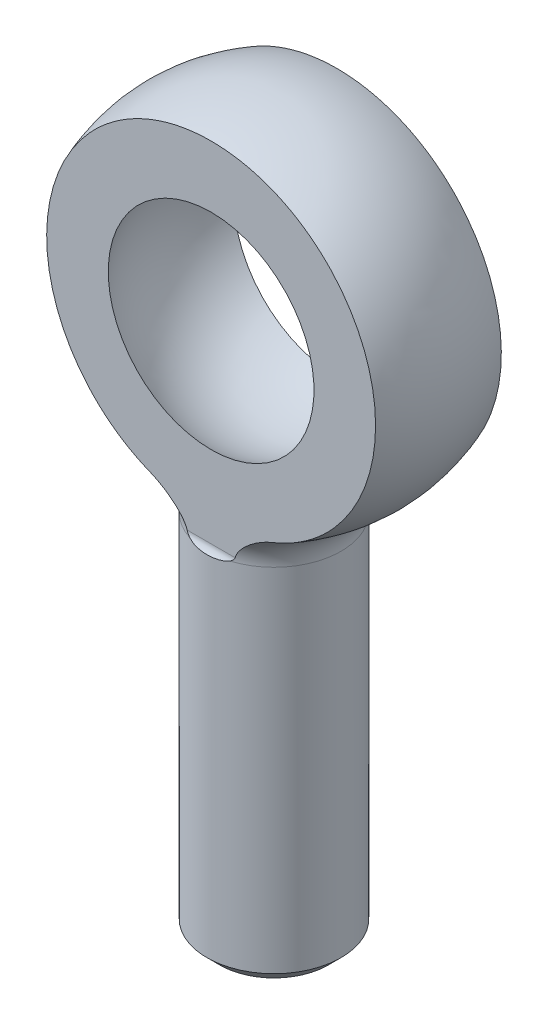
ISO-10303-21;
HEADER;
FILE_DESCRIPTION(('STEP AP214'),'2;1');
FILE_NAME('part.step','',(''),(''),'','','');
FILE_SCHEMA(('AUTOMOTIVE_DESIGN { 1 0 10303 214 1 1 1 1 }'));
ENDSEC;
DATA;
#1=APPLICATION_CONTEXT('core data for automotive mechanical design processes');
#2=APPLICATION_PROTOCOL_DEFINITION('international standard','automotive_design',2000,#1);
#3=PRODUCT_CONTEXT('',#1,'mechanical');
#4=PRODUCT('Part','Part','',(#3));
#5=PRODUCT_RELATED_PRODUCT_CATEGORY('part','',(#4));
#6=PRODUCT_DEFINITION_FORMATION('','',#4);
#7=PRODUCT_DEFINITION_CONTEXT('part definition',#1,'design');
#8=PRODUCT_DEFINITION('design','',#6,#7);
#9=PRODUCT_DEFINITION_SHAPE('','',#8);
#10=(LENGTH_UNIT() NAMED_UNIT(*) SI_UNIT(.MILLI.,.METRE.));
#11=(NAMED_UNIT(*) PLANE_ANGLE_UNIT() SI_UNIT($,.RADIAN.));
#12=(NAMED_UNIT(*) SI_UNIT($,.STERADIAN.) SOLID_ANGLE_UNIT());
#13=UNCERTAINTY_MEASURE_WITH_UNIT(LENGTH_MEASURE(1.E-05),#10,'distance_accuracy_value','');
#14=(GEOMETRIC_REPRESENTATION_CONTEXT(3) GLOBAL_UNCERTAINTY_ASSIGNED_CONTEXT((#13)) GLOBAL_UNIT_ASSIGNED_CONTEXT((#10,
#11,#12)) REPRESENTATION_CONTEXT('',''));
#15=CARTESIAN_POINT('',(0.,0.,0.));
#16=DIRECTION('',(0.,0.,1.));
#17=DIRECTION('',(1.,0.,0.));
#18=AXIS2_PLACEMENT_3D('',#15,#16,#17);
#19=CARTESIAN_POINT('',(0.,-22.5166604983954,0.));
#20=DIRECTION('',(0.,1.,0.));
#21=DIRECTION('',(0.,0.,1.));
#22=AXIS2_PLACEMENT_3D('',#19,#20,#21);
#23=TOROIDAL_SURFACE('',#22,13.,5.);
#24=CARTESIAN_POINT('',(-5.67432027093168,-19.0419464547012,7.49999998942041));
#25=CARTESIAN_POINT('',(-5.45015195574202,-19.1818861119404,7.49999997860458));
#26=CARTESIAN_POINT('',(-5.23085445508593,-19.3298114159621,7.49999999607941));
#27=CARTESIAN_POINT('',(-4.91038275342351,-19.5635943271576,7.50000000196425));
#28=CARTESIAN_POINT('',(-4.80486916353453,-19.6435911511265,7.50000000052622));
#29=CARTESIAN_POINT('',(-4.59704866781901,-19.8076405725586,7.49999999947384));
#30=CARTESIAN_POINT('',(-4.49474131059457,-19.8916925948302,7.49999999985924));
#31=CARTESIAN_POINT('',(-4.29411196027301,-20.0637737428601,7.50000000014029));
#32=CARTESIAN_POINT('',(-4.19577784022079,-20.1517887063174,7.50000000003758));
#33=CARTESIAN_POINT('',(-4.00342523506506,-20.3323922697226,7.49999999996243));
#34=CARTESIAN_POINT('',(-3.90940570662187,-20.4249797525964,7.49999999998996));
#35=CARTESIAN_POINT('',(-3.72694154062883,-20.6150399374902,7.50000000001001));
#36=CARTESIAN_POINT('',(-3.63848255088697,-20.7124987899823,7.50000000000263));
#37=CARTESIAN_POINT('',(-3.4685282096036,-20.9132633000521,7.49999999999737));
#38=CARTESIAN_POINT('',(-3.38702715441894,-21.0165640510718,7.49999999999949));
#39=CARTESIAN_POINT('',(-3.26910456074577,-21.1806850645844,7.50000000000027));
#40=CARTESIAN_POINT('',(-3.22927199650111,-21.2390477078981,7.50000000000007));
#41=CARTESIAN_POINT('',(-3.15298832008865,-21.3579373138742,7.49999999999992));
#42=CARTESIAN_POINT('',(-3.11653769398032,-21.4184645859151,7.49999999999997));
#43=CARTESIAN_POINT('',(-3.01352893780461,-21.6032358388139,7.50000000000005));
#44=CARTESIAN_POINT('',(-2.95301451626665,-21.7310698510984,7.50000000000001));
#45=CARTESIAN_POINT('',(-2.86865993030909,-21.9623523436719,7.49999999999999));
#46=CARTESIAN_POINT('',(-2.83941515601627,-22.0637912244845,7.49999999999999));
#47=CARTESIAN_POINT('',(-2.79833252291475,-22.2701371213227,7.5));
#48=CARTESIAN_POINT('',(-2.78646764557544,-22.3750384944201,7.5));
#49=CARTESIAN_POINT('',(-2.78205516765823,-22.5856264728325,7.5));
#50=CARTESIAN_POINT('',(-2.78957389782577,-22.6913145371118,7.5));
#51=CARTESIAN_POINT('',(-2.82277599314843,-22.8998154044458,7.5));
#52=CARTESIAN_POINT('',(-2.84848707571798,-23.002623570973,7.5));
#53=CARTESIAN_POINT('',(-2.92906403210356,-23.2474616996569,7.5));
#54=CARTESIAN_POINT('',(-2.99178095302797,-23.3868408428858,7.5));
#55=CARTESIAN_POINT('',(-3.13700966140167,-23.6549187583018,7.5));
#56=CARTESIAN_POINT('',(-3.21959475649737,-23.7835755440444,7.5));
#57=CARTESIAN_POINT('',(-3.40385272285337,-24.0403362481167,7.5));
#58=CARTESIAN_POINT('',(-3.50646379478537,-24.1677541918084,7.5));
#59=CARTESIAN_POINT('',(-3.72169606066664,-24.4139271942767,7.5));
#60=CARTESIAN_POINT('',(-3.83432838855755,-24.5326723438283,7.5));
#61=CARTESIAN_POINT('',(-4.06721424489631,-24.7630292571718,7.5));
#62=CARTESIAN_POINT('',(-4.18748751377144,-24.874620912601,7.5));
#63=CARTESIAN_POINT('',(-4.43381828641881,-25.0910992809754,7.5));
#64=CARTESIAN_POINT('',(-4.55987372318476,-25.195988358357,7.5));
#65=CARTESIAN_POINT('',(-4.80863857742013,-25.3929983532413,7.5));
#66=CARTESIAN_POINT('',(-4.93104207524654,-25.4855066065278,7.5));
#67=CARTESIAN_POINT('',(-5.17969005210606,-25.6652183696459,7.5));
#68=CARTESIAN_POINT('',(-5.30593498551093,-25.7524212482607,7.5));
#69=CARTESIAN_POINT('',(-5.69007101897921,-26.0061924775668,7.5));
#70=CARTESIAN_POINT('',(-5.95325591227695,-26.1648389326,7.5));
#71=CARTESIAN_POINT('',(-6.4914814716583,-26.4595099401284,7.5));
#72=CARTESIAN_POINT('',(-6.76650322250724,-26.5955690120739,7.5));
#73=CARTESIAN_POINT('',(-7.32718472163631,-26.8430349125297,7.5));
#74=CARTESIAN_POINT('',(-7.61283817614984,-26.9544560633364,7.5));
#75=CARTESIAN_POINT('',(-8.33846596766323,-27.19864022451,7.5));
#76=CARTESIAN_POINT('',(-8.7844719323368,-27.3144144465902,7.5));
#77=CARTESIAN_POINT('',(-9.46243852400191,-27.4333496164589,7.5));
#78=CARTESIAN_POINT('',(-9.68984391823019,-27.4638725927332,7.5));
#79=CARTESIAN_POINT('',(-10.1464914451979,-27.5053143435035,7.5));
#80=CARTESIAN_POINT('',(-10.3757332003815,-27.5162370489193,7.5));
#81=CARTESIAN_POINT('',(-10.7905309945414,-27.5169815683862,7.5));
#82=CARTESIAN_POINT('',(-10.9760861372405,-27.510428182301,7.5));
#83=CARTESIAN_POINT('',(-11.346174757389,-27.4828573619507,7.5));
#84=CARTESIAN_POINT('',(-11.5307080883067,-27.4618379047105,7.5));
#85=CARTESIAN_POINT('',(-11.897480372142,-27.4047091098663,7.5));
#86=CARTESIAN_POINT('',(-12.0797188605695,-27.3685967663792,7.5));
#87=CARTESIAN_POINT('',(-12.4403964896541,-27.2807886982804,7.5));
#88=CARTESIAN_POINT('',(-12.6188361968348,-27.229095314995,7.5));
#89=CARTESIAN_POINT('',(-12.9718902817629,-27.1092488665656,7.5));
#90=CARTESIAN_POINT('',(-13.1464568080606,-27.0409541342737,7.5));
#91=CARTESIAN_POINT('',(-13.4882056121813,-26.8880391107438,7.5));
#92=CARTESIAN_POINT('',(-13.6553917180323,-26.80342740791,7.5));
#93=CARTESIAN_POINT('',(-13.9804606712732,-26.6179942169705,7.5));
#94=CARTESIAN_POINT('',(-14.138347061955,-26.5171789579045,7.5));
#95=CARTESIAN_POINT('',(-14.4428137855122,-26.2997206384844,7.5));
#96=CARTESIAN_POINT('',(-14.5893965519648,-26.1830809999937,7.5));
#97=CARTESIAN_POINT('',(-14.8485190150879,-25.9530490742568,7.5));
#98=CARTESIAN_POINT('',(-14.9628908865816,-25.841715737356,7.5));
#99=CARTESIAN_POINT('',(-15.1806107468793,-25.6087544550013,7.5));
#100=CARTESIAN_POINT('',(-15.2839606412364,-25.4871282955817,7.5));
#101=CARTESIAN_POINT('',(-15.4783320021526,-25.2345192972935,7.5));
#102=CARTESIAN_POINT('',(-15.5693619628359,-25.1035430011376,7.5));
#103=CARTESIAN_POINT('',(-15.7380058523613,-24.8332196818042,7.5));
#104=CARTESIAN_POINT('',(-15.8156213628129,-24.6938736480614,7.5));
#105=CARTESIAN_POINT('',(-15.9475911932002,-24.4259388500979,7.5));
#106=CARTESIAN_POINT('',(-16.0036403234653,-24.2981821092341,7.5));
#107=CARTESIAN_POINT('',(-16.1040695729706,-24.0381662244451,7.5));
#108=CARTESIAN_POINT('',(-16.1484509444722,-23.9059075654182,7.5));
#109=CARTESIAN_POINT('',(-16.2250405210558,-23.6379665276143,7.5));
#110=CARTESIAN_POINT('',(-16.257253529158,-23.5022855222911,7.5));
#111=CARTESIAN_POINT('',(-16.3091655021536,-23.2285490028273,7.5));
#112=CARTESIAN_POINT('',(-16.3288648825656,-23.0904935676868,7.5));
#113=CARTESIAN_POINT('',(-16.3546357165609,-22.8224093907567,7.5));
#114=CARTESIAN_POINT('',(-16.3615279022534,-22.692458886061,7.5));
#115=CARTESIAN_POINT('',(-16.3641475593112,-22.4324000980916,7.5));
#116=CARTESIAN_POINT('',(-16.359871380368,-22.3022917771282,7.5));
#117=CARTESIAN_POINT('',(-16.3401943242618,-22.0429879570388,7.5));
#118=CARTESIAN_POINT('',(-16.3247991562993,-21.9137920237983,7.5));
#119=CARTESIAN_POINT('',(-16.2830377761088,-21.6571374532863,7.5));
#120=CARTESIAN_POINT('',(-16.2566675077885,-21.5296794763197,7.5));
#121=CARTESIAN_POINT('',(-16.1937135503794,-21.279428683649,7.5));
#122=CARTESIAN_POINT('',(-16.1572955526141,-21.1565941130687,7.5));
#123=CARTESIAN_POINT('',(-16.0744123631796,-20.9143165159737,7.5));
#124=CARTESIAN_POINT('',(-16.0279435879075,-20.7948747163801,7.5));
#125=CARTESIAN_POINT('',(-15.9254122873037,-20.5602341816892,7.5));
#126=CARTESIAN_POINT('',(-15.8693530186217,-20.4450340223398,7.5));
#127=CARTESIAN_POINT('',(-15.7481108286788,-20.2194910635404,7.5));
#128=CARTESIAN_POINT('',(-15.6829244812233,-20.1091501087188,7.5));
#129=CARTESIAN_POINT('',(-15.5419728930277,-19.8908523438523,7.5));
#130=CARTESIAN_POINT('',(-15.4659548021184,-19.7830586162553,7.5));
#131=CARTESIAN_POINT('',(-15.3055230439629,-19.5738917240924,7.5));
#132=CARTESIAN_POINT('',(-15.2211063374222,-19.4725209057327,7.5));
#133=CARTESIAN_POINT('',(-14.9563296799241,-19.1788832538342,7.5));
#134=CARTESIAN_POINT('',(-14.7643321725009,-18.9969208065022,7.49999999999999));
#135=CARTESIAN_POINT('',(-14.3409963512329,-18.6520275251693,7.5));
#136=CARTESIAN_POINT('',(-14.1078360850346,-18.4913527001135,7.50000000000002));
#137=CARTESIAN_POINT('',(-13.620015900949,-18.2069250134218,7.49999999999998));
#138=CARTESIAN_POINT('',(-13.3653471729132,-18.0831873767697,7.49999999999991));
#139=CARTESIAN_POINT('',(-12.8120354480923,-17.8612259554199,7.50000000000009));
#140=CARTESIAN_POINT('',(-12.511650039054,-17.7673628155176,7.50000000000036));
#141=CARTESIAN_POINT('',(-11.9006204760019,-17.6241288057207,7.49999999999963));
#142=CARTESIAN_POINT('',(-11.5899740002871,-17.5747680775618,7.49999999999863));
#143=CARTESIAN_POINT('',(-10.9171884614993,-17.5134955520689,7.50000000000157));
#144=CARTESIAN_POINT('',(-10.5544344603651,-17.5084586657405,7.50000000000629));
#145=CARTESIAN_POINT('',(-9.83142206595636,-17.5487134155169,7.4999999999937));
#146=CARTESIAN_POINT('',(-9.47116837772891,-17.5940825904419,7.49999999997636));
#147=CARTESIAN_POINT('',(-8.84700373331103,-17.712790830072,7.50000000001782));
#148=CARTESIAN_POINT('',(-8.5811854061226,-17.7765088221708,7.50000000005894));
#149=CARTESIAN_POINT('',(-8.05600776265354,-17.9269774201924,7.49999999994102));
#150=CARTESIAN_POINT('',(-7.79665203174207,-18.0137405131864,7.49999999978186));
#151=CARTESIAN_POINT('',(-7.286293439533,-18.2079173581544,7.50000000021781));
#152=CARTESIAN_POINT('',(-7.03527887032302,-18.3153005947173,7.50000000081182));
#153=CARTESIAN_POINT('',(-6.54231805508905,-18.5488642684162,7.49999999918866));
#154=CARTESIAN_POINT('',(-6.30036654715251,-18.6750335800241,7.49999999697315));
#155=CARTESIAN_POINT('',(-5.99784723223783,-18.8472079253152,7.50000000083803));
#156=CARTESIAN_POINT('',(-5.93263683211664,-18.8852055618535,7.5000000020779));
#157=CARTESIAN_POINT('',(-5.80292430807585,-18.962565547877,7.49999999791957));
#158=CARTESIAN_POINT('',(-5.73842314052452,-19.001929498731,7.49999999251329));
#159=CARTESIAN_POINT('',(-5.67432027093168,-19.0419464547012,7.49999998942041));
#160=B_SPLINE_CURVE_WITH_KNOTS('',3,(#24,#25,#26,#27,#28,#29,#30,#31,#32,#33,#34,#35,#36,#37,
#38,#39,#40,#41,#42,#43,#44,#45,#46,#47,#48,#49,#50,#51,#52,#53,#54,#55,#56,#57,#58,#59,#60,#61,
#62,#63,#64,#65,#66,#67,#68,#69,#70,#71,#72,#73,#74,#75,#76,#77,#78,#79,#80,#81,#82,#83,#84,#85,
#86,#87,#88,#89,#90,#91,#92,#93,#94,#95,#96,#97,#98,#99,#100,#101,#102,#103,#104,#105,#106,#107,
#108,#109,#110,#111,#112,#113,#114,#115,#116,#117,#118,#119,#120,#121,#122,#123,#124,#125,#126,
#127,#128,#129,#130,#131,#132,#133,#134,#135,#136,#137,#138,#139,#140,#141,#142,#143,#144,#145,
#146,#147,#148,#149,#150,#151,#152,#153,#154,#155,#156,#157,#158,#159),.UNSPECIFIED.,.T.,.F.,(4,
2,2,2,2,2,2,2,2,2,2,2,2,2,2,2,2,2,2,2,2,2,2,2,2,2,2,2,2,2,2,2,2,2,2,2,2,2,2,2,2,2,2,2,2,2,2,2,2,
2,2,2,2,2,2,2,2,2,2,2,2,2,2,2,2,2,2,4),(0.,0.792719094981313,1.18988048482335,1.58698570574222,
1.98276974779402,2.3784575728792,2.7730781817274,3.16737213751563,3.37924446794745,
3.59114720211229,4.01346111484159,4.32896512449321,4.6439781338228,4.9600705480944,
5.2766455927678,5.73254298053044,6.19014901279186,6.68020036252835,7.17080314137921,
7.66272944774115,8.15448125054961,8.61461747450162,9.07480833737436,9.99559883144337,
10.9149688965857,11.8338031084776,13.2100541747,13.8977266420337,14.585261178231,
15.1417608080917,15.6983382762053,16.2550266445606,16.8116314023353,17.3731638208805,
17.9344014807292,18.495423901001,19.0563251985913,19.5344882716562,20.0125685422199,
20.4903174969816,20.968010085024,21.3860029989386,21.8039510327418,22.2217339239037,
22.6395029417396,23.0294299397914,23.4194843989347,23.8093387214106,24.1993372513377,
24.5832537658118,24.9673073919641,25.3512308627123,25.7352988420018,26.1305547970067,
26.5259543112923,27.3161500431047,28.1622291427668,29.0086565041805,29.9491017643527,
30.8897612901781,31.974158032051,33.0602251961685,33.8792295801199,34.6986786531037,
35.5169242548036,36.3346871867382,36.5610971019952,36.7877819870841),.UNSPECIFIED.);
#161=CARTESIAN_POINT('',(-7.34846922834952,-18.1865334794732,7.5));
#162=VERTEX_POINT('',#161);
#163=CARTESIAN_POINT('',(-2.8598887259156,-22.,7.5));
#164=VERTEX_POINT('',#163);
#165=EDGE_CURVE('E87',#162,#164,#160,.T.);
#166=ORIENTED_EDGE('',*,*,#165,.F.);
#167=CARTESIAN_POINT('',(0.,-18.1865334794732,0.));
#168=DIRECTION('',(0.,1.,0.));
#169=DIRECTION('',(0.,0.,1.));
#170=AXIS2_PLACEMENT_3D('',#167,#168,#169);
#171=CIRCLE('',#170,10.5);
#172=CARTESIAN_POINT('',(-7.34846922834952,-18.1865334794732,-7.5));
#173=VERTEX_POINT('',#172);
#174=EDGE_CURVE('E159',#173,#162,#171,.T.);
#175=ORIENTED_EDGE('',*,*,#174,.F.);
#176=CARTESIAN_POINT('',(-5.67432027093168,-19.0419464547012,-7.49999998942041));
#177=CARTESIAN_POINT('',(-5.92675542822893,-18.8843462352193,-7.49999998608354));
#178=CARTESIAN_POINT('',(-6.18553031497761,-18.7367879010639,-7.49999999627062));
#179=CARTESIAN_POINT('',(-6.71435090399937,-18.4631792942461,-7.50000000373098));
#180=CARTESIAN_POINT('',(-6.98440137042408,-18.3371382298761,-7.50000000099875));
#181=CARTESIAN_POINT('',(-7.53437538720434,-18.1088923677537,-7.49999999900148));
#182=CARTESIAN_POINT('',(-7.81429665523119,-18.0066821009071,-7.49999999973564));
#183=CARTESIAN_POINT('',(-8.38240645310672,-17.8288524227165,-7.50000000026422));
#184=CARTESIAN_POINT('',(-8.67059040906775,-17.7532185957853,-7.50000000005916));
#185=CARTESIAN_POINT('',(-9.16636086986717,-17.6496678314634,-7.49999999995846));
#186=CARTESIAN_POINT('',(-9.37239693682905,-17.6142485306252,-7.49999999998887));
#187=CARTESIAN_POINT('',(-9.78654605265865,-17.5590993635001,-7.50000000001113));
#188=CARTESIAN_POINT('',(-9.99465858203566,-17.5393656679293,-7.50000000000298));
#189=CARTESIAN_POINT('',(-10.4115479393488,-17.5166856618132,-7.49999999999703));
#190=CARTESIAN_POINT('',(-10.6203235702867,-17.5137178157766,-7.49999999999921));
#191=CARTESIAN_POINT('',(-11.0373825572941,-17.5255543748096,-7.50000000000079));
#192=CARTESIAN_POINT('',(-11.2456659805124,-17.540356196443,-7.5000000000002));
#193=CARTESIAN_POINT('',(-11.6261420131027,-17.5847087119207,-7.49999999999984));
#194=CARTESIAN_POINT('',(-11.798664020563,-17.6114500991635,-7.49999999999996));
#195=CARTESIAN_POINT('',(-12.1411069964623,-17.678488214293,-7.50000000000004));
#196=CARTESIAN_POINT('',(-12.3110275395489,-17.7187871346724,-7.50000000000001));
#197=CARTESIAN_POINT('',(-12.6469973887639,-17.8133103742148,-7.49999999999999));
#198=CARTESIAN_POINT('',(-12.8130460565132,-17.8675369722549,-7.5));
#199=CARTESIAN_POINT('',(-13.1398328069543,-17.990132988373,-7.50000000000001));
#200=CARTESIAN_POINT('',(-13.3005715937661,-18.0585005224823,-7.5));
#201=CARTESIAN_POINT('',(-13.6164783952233,-18.2100328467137,-7.5));
#202=CARTESIAN_POINT('',(-13.7715934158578,-18.2933084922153,-7.5));
#203=CARTESIAN_POINT('',(-14.0732046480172,-18.474107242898,-7.5));
#204=CARTESIAN_POINT('',(-14.2197051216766,-18.5716232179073,-7.5));
#205=CARTESIAN_POINT('',(-14.5024161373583,-18.7805235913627,-7.5));
#206=CARTESIAN_POINT('',(-14.6386296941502,-18.8919039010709,-7.5));
#207=CARTESIAN_POINT('',(-14.8990563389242,-19.1279048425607,-7.5));
#208=CARTESIAN_POINT('',(-15.0232715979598,-19.2525230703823,-7.5));
#209=CARTESIAN_POINT('',(-15.2422189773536,-19.4964926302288,-7.5));
#210=CARTESIAN_POINT('',(-15.3386703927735,-19.6143044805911,-7.5));
#211=CARTESIAN_POINT('',(-15.5202231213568,-19.8583655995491,-7.5));
#212=CARTESIAN_POINT('',(-15.6053260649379,-19.9846136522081,-7.5));
#213=CARTESIAN_POINT('',(-15.7631414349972,-20.2445347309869,-7.5));
#214=CARTESIAN_POINT('',(-15.8358611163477,-20.3782033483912,-7.5));
#215=CARTESIAN_POINT('',(-15.9680700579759,-20.651931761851,-7.5));
#216=CARTESIAN_POINT('',(-16.0275604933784,-20.7919909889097,-7.5));
#217=CARTESIAN_POINT('',(-16.1269603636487,-21.0620646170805,-7.5));
#218=CARTESIAN_POINT('',(-16.1682798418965,-21.1915618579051,-7.5));
#219=CARTESIAN_POINT('',(-16.2393139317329,-21.4536974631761,-7.5));
#220=CARTESIAN_POINT('',(-16.2690295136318,-21.5863355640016,-7.5));
#221=CARTESIAN_POINT('',(-16.3165290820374,-21.8536885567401,-7.5));
#222=CARTESIAN_POINT('',(-16.3343168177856,-21.9884027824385,-7.5));
#223=CARTESIAN_POINT('',(-16.3577807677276,-22.258882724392,-7.5));
#224=CARTESIAN_POINT('',(-16.3634572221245,-22.3946484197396,-7.5));
#225=CARTESIAN_POINT('',(-16.3626585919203,-22.6591947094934,-7.5));
#226=CARTESIAN_POINT('',(-16.3567899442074,-22.7879775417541,-7.5));
#227=CARTESIAN_POINT('',(-16.3341487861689,-23.0446250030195,-7.5));
#228=CARTESIAN_POINT('',(-16.317372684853,-23.1724893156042,-7.5));
#229=CARTESIAN_POINT('',(-16.2730887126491,-23.4262836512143,-7.5));
#230=CARTESIAN_POINT('',(-16.2455857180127,-23.5522145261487,-7.5));
#231=CARTESIAN_POINT('',(-16.1801033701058,-23.8013702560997,-7.5));
#232=CARTESIAN_POINT('',(-16.1421201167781,-23.9245940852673,-7.5));
#233=CARTESIAN_POINT('',(-16.0561480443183,-24.16716362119,-7.5));
#234=CARTESIAN_POINT('',(-16.008183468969,-24.2865179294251,-7.5));
#235=CARTESIAN_POINT('',(-15.902619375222,-24.5209340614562,-7.5));
#236=CARTESIAN_POINT('',(-15.8450164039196,-24.6359943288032,-7.5));
#237=CARTESIAN_POINT('',(-15.7207221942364,-24.8610480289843,-7.5));
#238=CARTESIAN_POINT('',(-15.654033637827,-24.9710429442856,-7.5));
#239=CARTESIAN_POINT('',(-15.5121073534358,-25.1854219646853,-7.5));
#240=CARTESIAN_POINT('',(-15.4368664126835,-25.2898039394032,-7.5));
#241=CARTESIAN_POINT('',(-15.2752137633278,-25.4965445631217,-7.5));
#242=CARTESIAN_POINT('',(-15.188470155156,-25.5986439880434,-7.5));
#243=CARTESIAN_POINT('',(-15.0071403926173,-25.7956451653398,-7.5));
#244=CARTESIAN_POINT('',(-14.9125513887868,-25.8905442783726,-7.5));
#245=CARTESIAN_POINT('',(-14.6181840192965,-26.1637384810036,-7.5));
#246=CARTESIAN_POINT('',(-14.4076854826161,-26.3306822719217,-7.5));
#247=CARTESIAN_POINT('',(-13.9463913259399,-26.6440975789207,-7.5));
#248=CARTESIAN_POINT('',(-13.6937060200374,-26.7877618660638,-7.5));
#249=CARTESIAN_POINT('',(-13.1697926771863,-27.0358734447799,-7.5));
#250=CARTESIAN_POINT('',(-12.8985565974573,-27.1403035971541,-7.5));
#251=CARTESIAN_POINT('',(-12.3102895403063,-27.3209106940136,-7.5));
#252=CARTESIAN_POINT('',(-11.9917221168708,-27.3920512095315,-7.5));
#253=CARTESIAN_POINT('',(-11.3477561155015,-27.4880132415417,-7.5));
#254=CARTESIAN_POINT('',(-11.0223552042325,-27.512818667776,-7.5));
#255=CARTESIAN_POINT('',(-10.464693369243,-27.5186950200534,-7.5));
#256=CARTESIAN_POINT('',(-10.2324547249,-27.5102589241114,-7.5));
#257=CARTESIAN_POINT('',(-9.76953215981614,-27.4730960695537,-7.5));
#258=CARTESIAN_POINT('',(-9.53884878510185,-27.4443625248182,-7.5));
#259=CARTESIAN_POINT('',(-9.08005536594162,-27.3680053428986,-7.5));
#260=CARTESIAN_POINT('',(-8.85195356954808,-27.3203327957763,-7.5));
#261=CARTESIAN_POINT('',(-8.40013191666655,-27.2076147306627,-7.5));
#262=CARTESIAN_POINT('',(-8.17641192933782,-27.1425697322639,-7.5));
#263=CARTESIAN_POINT('',(-7.67126103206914,-26.9757244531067,-7.5));
#264=CARTESIAN_POINT('',(-7.39153899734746,-26.8687321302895,-7.5));
#265=CARTESIAN_POINT('',(-6.84225245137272,-26.6310967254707,-7.5));
#266=CARTESIAN_POINT('',(-6.57269322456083,-26.5004415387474,-7.5));
#267=CARTESIAN_POINT('',(-6.04562992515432,-26.2179472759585,-7.5));
#268=CARTESIAN_POINT('',(-5.78810144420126,-26.0661538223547,-7.5));
#269=CARTESIAN_POINT('',(-5.41168391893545,-25.8234448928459,-7.5));
#270=CARTESIAN_POINT('',(-5.28788221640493,-25.7400578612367,-7.5));
#271=CARTESIAN_POINT('',(-5.04381849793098,-25.5682725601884,-7.5));
#272=CARTESIAN_POINT('',(-4.92355620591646,-25.4798746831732,-7.5));
#273=CARTESIAN_POINT('',(-4.63161956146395,-25.2554881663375,-7.5));
#274=CARTESIAN_POINT('',(-4.46217336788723,-25.1165588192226,-7.5));
#275=CARTESIAN_POINT('',(-4.21576803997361,-24.8991714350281,-7.5));
#276=CARTESIAN_POINT('',(-4.13486841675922,-24.8251504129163,-7.5));
#277=CARTESIAN_POINT('',(-3.97614309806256,-24.6738886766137,-7.5));
#278=CARTESIAN_POINT('',(-3.89831694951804,-24.5966484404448,-7.5));
#279=CARTESIAN_POINT('',(-3.74570533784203,-24.4379618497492,-7.5));
#280=CARTESIAN_POINT('',(-3.67095057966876,-24.3564858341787,-7.5));
#281=CARTESIAN_POINT('',(-3.52606828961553,-24.1894333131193,-7.5));
#282=CARTESIAN_POINT('',(-3.45594260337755,-24.1038551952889,-7.5));
#283=CARTESIAN_POINT('',(-3.32189392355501,-23.9282536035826,-7.5));
#284=CARTESIAN_POINT('',(-3.25795620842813,-23.8382414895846,-7.5));
#285=CARTESIAN_POINT('',(-3.13821689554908,-23.6530176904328,-7.5));
#286=CARTESIAN_POINT('',(-3.08240663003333,-23.5578116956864,-7.5));
#287=CARTESIAN_POINT('',(-2.98056421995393,-23.3590447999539,-7.5));
#288=CARTESIAN_POINT('',(-2.93482122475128,-23.2553317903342,-7.5));
#289=CARTESIAN_POINT('',(-2.85950157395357,-23.0422667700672,-7.5));
#290=CARTESIAN_POINT('',(-2.82988525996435,-22.9329293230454,-7.5));
#291=CARTESIAN_POINT('',(-2.79095405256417,-22.7091505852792,-7.5));
#292=CARTESIAN_POINT('',(-2.78188674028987,-22.5946638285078,-7.50000000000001));
#293=CARTESIAN_POINT('',(-2.78663274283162,-22.3661611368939,-7.5));
#294=CARTESIAN_POINT('',(-2.80045417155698,-22.2521453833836,-7.49999999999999));
#295=CARTESIAN_POINT('',(-2.85137417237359,-22.0141749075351,-7.50000000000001));
#296=CARTESIAN_POINT('',(-2.8912511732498,-21.8908410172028,-7.50000000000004));
#297=CARTESIAN_POINT('',(-2.98987274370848,-21.6518495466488,-7.49999999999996));
#298=CARTESIAN_POINT('',(-3.04868293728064,-21.5362203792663,-7.49999999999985));
#299=CARTESIAN_POINT('',(-3.17614463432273,-21.3178891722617,-7.50000000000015));
#300=CARTESIAN_POINT('',(-3.24421049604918,-21.2148359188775,-7.50000000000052));
#301=CARTESIAN_POINT('',(-3.3887363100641,-21.014726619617,-7.49999999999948));
#302=CARTESIAN_POINT('',(-3.4652046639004,-20.9176767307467,-7.49999999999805));
#303=CARTESIAN_POINT('',(-3.62441929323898,-20.7286747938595,-7.50000000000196));
#304=CARTESIAN_POINT('',(-3.70717482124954,-20.6367306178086,-7.50000000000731));
#305=CARTESIAN_POINT('',(-3.87750026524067,-20.4574006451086,-7.49999999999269));
#306=CARTESIAN_POINT('',(-3.96507149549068,-20.3700161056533,-7.49999999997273));
#307=CARTESIAN_POINT('',(-4.17792688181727,-20.167092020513,-7.50000000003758));
#308=CARTESIAN_POINT('',(-4.30495963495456,-20.0533882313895,-7.50000000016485));
#309=CARTESIAN_POINT('',(-4.56494949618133,-19.8329577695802,-7.49999999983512));
#310=CARTESIAN_POINT('',(-4.6979079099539,-19.7262326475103,-7.49999999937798));
#311=CARTESIAN_POINT('',(-4.96884268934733,-19.5194369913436,-7.50000000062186));
#312=CARTESIAN_POINT('',(-5.10681772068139,-19.4193647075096,-7.50000000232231));
#313=CARTESIAN_POINT('',(-5.38727524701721,-19.2257455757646,-7.49999999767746));
#314=CARTESIAN_POINT('',(-5.52975819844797,-19.1321993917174,-7.49999999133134));
#315=CARTESIAN_POINT('',(-5.67432027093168,-19.0419464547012,-7.49999998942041));
#316=B_SPLINE_CURVE_WITH_KNOTS('',3,(#176,#177,#178,#179,#180,#181,#182,#183,#184,#185,#186,
#187,#188,#189,#190,#191,#192,#193,#194,#195,#196,#197,#198,#199,#200,#201,#202,#203,#204,#205,
#206,#207,#208,#209,#210,#211,#212,#213,#214,#215,#216,#217,#218,#219,#220,#221,#222,#223,#224,
#225,#226,#227,#228,#229,#230,#231,#232,#233,#234,#235,#236,#237,#238,#239,#240,#241,#242,#243,
#244,#245,#246,#247,#248,#249,#250,#251,#252,#253,#254,#255,#256,#257,#258,#259,#260,#261,#262,
#263,#264,#265,#266,#267,#268,#269,#270,#271,#272,#273,#274,#275,#276,#277,#278,#279,#280,#281,
#282,#283,#284,#285,#286,#287,#288,#289,#290,#291,#292,#293,#294,#295,#296,#297,#298,#299,#300,
#301,#302,#303,#304,#305,#306,#307,#308,#309,#310,#311,#312,#313,#314,#315),.UNSPECIFIED.,.T.,
.F.,(4,2,2,2,2,2,2,2,2,2,2,2,2,2,2,2,2,2,2,2,2,2,2,2,2,2,2,2,2,2,2,2,2,2,2,2,2,2,2,2,2,2,2,2,2,
2,2,2,2,2,2,2,2,2,2,2,2,2,2,2,2,2,2,2,2,2,2,2,2,4),(0.,0.892639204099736,1.78565945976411,
2.67847456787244,3.57080464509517,4.19744969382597,4.82394171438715,5.44962883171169,
6.07522499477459,6.59846657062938,7.1217928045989,7.64520472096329,8.16854694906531,
8.69595586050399,9.2231015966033,9.75009223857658,10.2769873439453,10.7331363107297,
11.189219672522,11.6450349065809,12.1008096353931,12.5080824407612,12.9153211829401,
13.3224318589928,13.7295344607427,14.1158230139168,14.5022388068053,14.8884791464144,
15.2748634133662,15.6603199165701,16.0459148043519,16.4313961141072,16.8170227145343,
17.2184891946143,17.620102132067,18.4227541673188,19.2913238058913,20.160272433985,
21.1358012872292,22.1116688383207,22.8079791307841,23.5045223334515,24.2028761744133,
24.901209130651,25.7984151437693,26.6960814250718,27.5918394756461,28.0395306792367,
28.4871868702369,29.1439698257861,29.4728614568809,29.8017044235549,30.1332848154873,
30.4649966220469,30.795898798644,31.1264454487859,31.465513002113,31.8037429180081,
32.1460267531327,32.4884319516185,32.8751061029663,33.2631351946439,33.6330991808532,
34.0034365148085,34.374329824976,34.7453248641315,35.256482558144,35.7677534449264,
36.278889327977,36.7900771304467),.UNSPECIFIED.);
#317=CARTESIAN_POINT('',(-2.85988872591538,-22.,-7.5));
#318=VERTEX_POINT('',#317);
#319=EDGE_CURVE('E56',#318,#173,#316,.T.);
#320=ORIENTED_EDGE('',*,*,#319,.F.);
#321=CARTESIAN_POINT('',(-2.3601543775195,-22.5168604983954,-7.64393036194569));
#322=CARTESIAN_POINT('',(-2.38775470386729,-22.5027350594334,-7.6354121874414));
#323=CARTESIAN_POINT('',(-2.41499254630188,-22.4878563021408,-7.6268962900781));
#324=CARTESIAN_POINT('',(-2.4686030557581,-22.4563302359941,-7.61000648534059));
#325=CARTESIAN_POINT('',(-2.49497240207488,-22.4396769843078,-7.60163317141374));
#326=CARTESIAN_POINT('',(-2.54720040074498,-22.4039637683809,-7.58500792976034));
#327=CARTESIAN_POINT('',(-2.57302654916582,-22.3848513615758,-7.57676523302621));
#328=CARTESIAN_POINT('',(-2.62300051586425,-22.3443675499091,-7.56091369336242));
#329=CARTESIAN_POINT('',(-2.64715078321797,-22.3229995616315,-7.55330392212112));
#330=CARTESIAN_POINT('',(-2.69617967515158,-22.2749213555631,-7.53816274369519));
#331=CARTESIAN_POINT('',(-2.7207757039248,-22.2478772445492,-7.53075865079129));
#332=CARTESIAN_POINT('',(-2.765995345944,-22.1906243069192,-7.51790423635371));
#333=CARTESIAN_POINT('',(-2.78665809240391,-22.1604518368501,-7.51243414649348));
#334=CARTESIAN_POINT('',(-2.81626138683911,-22.1084838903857,-7.50569470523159));
#335=CARTESIAN_POINT('',(-2.82672424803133,-22.087664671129,-7.5036206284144));
#336=CARTESIAN_POINT('',(-2.84528071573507,-22.0446692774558,-7.5007622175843));
#337=CARTESIAN_POINT('',(-2.85334931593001,-22.0224815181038,-7.49999112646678));
#338=CARTESIAN_POINT('',(-2.85994700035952,-21.9997999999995,-7.50000002));
#339=B_SPLINE_CURVE_WITH_KNOTS('',3,(#321,#322,#323,#324,#325,#326,#327,#328,#329,#330,#331,
#332,#333,#334,#335,#336,#337,#338),.UNSPECIFIED.,.F.,.F.,(4,2,2,2,2,2,2,2,4),(0.,
0.0964789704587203,0.193291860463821,0.292693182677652,0.391946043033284,0.503535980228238,
0.613949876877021,0.683948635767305,0.754654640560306),.UNSPECIFIED.);
#340=CARTESIAN_POINT('',(-2.36054530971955,-22.5166604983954,-7.64380964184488));
#341=VERTEX_POINT('',#340);
#342=EDGE_CURVE('E168',#341,#318,#339,.T.);
#343=ORIENTED_EDGE('',*,*,#342,.F.);
#344=CARTESIAN_POINT('',(0.,-22.5166604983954,0.));
#345=DIRECTION('',(0.,1.,0.));
#346=DIRECTION('',(0.,0.,1.));
#347=AXIS2_PLACEMENT_3D('',#344,#345,#346);
#348=CIRCLE('',#347,7.99999999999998);
#349=CARTESIAN_POINT('',(-2.36054530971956,-22.5166604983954,7.64380964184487));
#350=VERTEX_POINT('',#349);
#351=EDGE_CURVE('E109',#341,#350,#348,.T.);
#352=ORIENTED_EDGE('',*,*,#351,.T.);
#353=CARTESIAN_POINT('',(-2.85994700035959,-21.9997999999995,7.50000002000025));
#354=CARTESIAN_POINT('',(-2.85040918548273,-22.0325890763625,7.49998650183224));
#355=CARTESIAN_POINT('',(-2.83784058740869,-22.0642453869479,7.50159707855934));
#356=CARTESIAN_POINT('',(-2.80811093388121,-22.1244967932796,7.50732864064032));
#357=CARTESIAN_POINT('',(-2.7910245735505,-22.1531319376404,7.51141007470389));
#358=CARTESIAN_POINT('',(-2.74583494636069,-22.2184561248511,7.52338005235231));
#359=CARTESIAN_POINT('',(-2.71605655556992,-22.2537973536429,7.53213795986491));
#360=CARTESIAN_POINT('',(-2.65164752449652,-22.31966590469,7.55184011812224));
#361=CARTESIAN_POINT('',(-2.61696621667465,-22.3501348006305,7.56280778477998));
#362=CARTESIAN_POINT('',(-2.54594904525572,-22.4053916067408,7.58538741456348));
#363=CARTESIAN_POINT('',(-2.50973527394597,-22.4303583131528,7.59695591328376));
#364=CARTESIAN_POINT('',(-2.43592108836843,-22.4762701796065,7.62034226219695));
#365=CARTESIAN_POINT('',(-2.39836006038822,-22.4972826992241,7.63215120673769));
#366=CARTESIAN_POINT('',(-2.36015437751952,-22.5168604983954,7.64393036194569));
#367=B_SPLINE_CURVE_WITH_KNOTS('',3,(#353,#354,#355,#356,#357,#358,#359,#360,#361,#362,#363,
#364,#365,#366),.UNSPECIFIED.,.F.,.F.,(4,2,2,2,2,2,4),(0.,0.101902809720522,0.202216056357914,
0.342571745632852,0.484501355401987,0.620740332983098,0.75439240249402),.UNSPECIFIED.);
#368=EDGE_CURVE('E101',#164,#350,#367,.T.);
#369=ORIENTED_EDGE('',*,*,#368,.F.);
#370=EDGE_LOOP('',(#166,#175,#320,#343,#352,#369));
#371=FACE_BOUND('',#370,.T.);
#372=ADVANCED_FACE('F32',(#371),#23,.F.);
#373=CARTESIAN_POINT('',(4.06653977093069,-20.273305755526,7.5));
#374=CARTESIAN_POINT('',(4.17101541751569,-20.1741132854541,7.5));
#375=CARTESIAN_POINT('',(4.27811068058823,-20.077687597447,7.5));
#376=CARTESIAN_POINT('',(4.49665377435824,-19.889874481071,7.5));
#377=CARTESIAN_POINT('',(4.60810256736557,-19.7984881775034,7.5));
#378=CARTESIAN_POINT('',(4.83485398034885,-19.6204332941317,7.5));
#379=CARTESIAN_POINT('',(4.95015974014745,-19.5337687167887,7.5));
#380=CARTESIAN_POINT('',(5.1841555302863,-19.3651273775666,7.5));
#381=CARTESIAN_POINT('',(5.3028459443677,-19.2831511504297,7.5));
#382=CARTESIAN_POINT('',(5.6638283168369,-19.0440694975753,7.5));
#383=CARTESIAN_POINT('',(5.91081919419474,-18.8939767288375,7.5));
#384=CARTESIAN_POINT('',(6.41560678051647,-18.6135696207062,7.5));
#385=CARTESIAN_POINT('',(6.67339830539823,-18.483245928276,7.5));
#386=CARTESIAN_POINT('',(7.20412191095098,-18.2416580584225,7.5));
#387=CARTESIAN_POINT('',(7.47725461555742,-18.1308319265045,7.5));
#388=CARTESIAN_POINT('',(8.03246701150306,-17.9339941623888,7.5));
#389=CARTESIAN_POINT('',(8.31454911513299,-17.8479892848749,7.5));
#390=CARTESIAN_POINT('',(8.88472309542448,-17.7039648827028,7.5));
#391=CARTESIAN_POINT('',(9.1727889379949,-17.6458432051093,7.5));
#392=CARTESIAN_POINT('',(9.75338595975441,-17.5601799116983,7.5));
#393=CARTESIAN_POINT('',(10.0459140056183,-17.5326177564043,7.5));
#394=CARTESIAN_POINT('',(10.5262401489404,-17.5149287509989,7.5));
#395=CARTESIAN_POINT('',(10.7137079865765,-17.5148771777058,7.5));
#396=CARTESIAN_POINT('',(11.0880815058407,-17.5291922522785,7.5));
#397=CARTESIAN_POINT('',(11.2749873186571,-17.5435552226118,7.5));
#398=CARTESIAN_POINT('',(11.6470995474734,-17.5873806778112,7.5));
#399=CARTESIAN_POINT('',(11.8323053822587,-17.6168481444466,7.5));
#400=CARTESIAN_POINT('',(12.1995638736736,-17.6914596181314,7.5));
#401=CARTESIAN_POINT('',(12.3816164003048,-17.7366042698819,7.5));
#402=CARTESIAN_POINT('',(12.7425195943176,-17.8434586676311,7.5));
#403=CARTESIAN_POINT('',(12.9213294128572,-17.9053071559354,7.5));
#404=CARTESIAN_POINT('',(13.2722983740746,-18.0456314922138,7.5));
#405=CARTESIAN_POINT('',(13.4444585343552,-18.1241047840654,7.5));
#406=CARTESIAN_POINT('',(13.780107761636,-18.2976445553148,7.5));
#407=CARTESIAN_POINT('',(13.9436016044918,-18.3927017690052,7.5));
#408=CARTESIAN_POINT('',(14.259927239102,-18.59915416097,7.5));
#409=CARTESIAN_POINT('',(14.4127612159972,-18.7105459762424,7.5));
#410=CARTESIAN_POINT('',(14.6850543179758,-18.9322889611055,7.5));
#411=CARTESIAN_POINT('',(14.8061864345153,-19.0405899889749,7.5));
#412=CARTESIAN_POINT('',(15.0376223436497,-19.268193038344,7.5));
#413=CARTESIAN_POINT('',(15.1479281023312,-19.3874930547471,7.5));
#414=CARTESIAN_POINT('',(15.3563111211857,-19.636203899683,7.5));
#415=CARTESIAN_POINT('',(15.4543968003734,-19.765607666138,7.5));
#416=CARTESIAN_POINT('',(15.6371506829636,-20.0335667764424,7.5));
#417=CARTESIAN_POINT('',(15.7218206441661,-20.1721209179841,7.5));
#418=CARTESIAN_POINT('',(15.8664532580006,-20.4384714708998,7.5));
#419=CARTESIAN_POINT('',(15.9281992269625,-20.5653026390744,7.5));
#420=CARTESIAN_POINT('',(16.0400193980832,-20.8240047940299,7.5));
#421=CARTESIAN_POINT('',(16.0900949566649,-20.9558751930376,7.5));
#422=CARTESIAN_POINT('',(16.1779984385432,-21.2235756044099,7.5));
#423=CARTESIAN_POINT('',(16.2158316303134,-21.3594038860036,7.5));
#424=CARTESIAN_POINT('',(16.2788446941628,-21.6339658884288,7.5));
#425=CARTESIAN_POINT('',(16.3040250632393,-21.7726994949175,7.5));
#426=CARTESIAN_POINT('',(16.3400806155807,-22.0417551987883,7.5));
#427=CARTESIAN_POINT('',(16.3518616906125,-22.1719566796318,7.5));
#428=CARTESIAN_POINT('',(16.3641741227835,-22.4329364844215,7.5));
#429=CARTESIAN_POINT('',(16.3647018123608,-22.5637149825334,7.5));
#430=CARTESIAN_POINT('',(16.354494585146,-22.8247600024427,7.5));
#431=CARTESIAN_POINT('',(16.343765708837,-22.9550267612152,7.5));
#432=CARTESIAN_POINT('',(16.3111580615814,-23.2142057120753,7.5));
#433=CARTESIAN_POINT('',(16.2892751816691,-23.3431173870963,7.5));
#434=CARTESIAN_POINT('',(16.2351444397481,-23.5959567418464,7.5));
#435=CARTESIAN_POINT('',(16.2031200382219,-23.7199323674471,7.5));
#436=CARTESIAN_POINT('',(16.1288801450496,-23.9648398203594,7.5));
#437=CARTESIAN_POINT('',(16.0866610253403,-24.0857705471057,7.5));
#438=CARTESIAN_POINT('',(15.9924478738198,-24.3237088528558,7.5));
#439=CARTESIAN_POINT('',(15.9404573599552,-24.4407178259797,7.5));
#440=CARTESIAN_POINT('',(15.8271435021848,-24.6701734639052,7.5));
#441=CARTESIAN_POINT('',(15.7658166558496,-24.7826183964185,7.5));
#442=CARTESIAN_POINT('',(15.6327563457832,-25.004952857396,7.5));
#443=CARTESIAN_POINT('',(15.5608041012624,-25.1147115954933,7.5));
#444=CARTESIAN_POINT('',(15.4083075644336,-25.3281072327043,7.5));
#445=CARTESIAN_POINT('',(15.327760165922,-25.4317418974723,7.5));
#446=CARTESIAN_POINT('',(15.0742543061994,-25.7325732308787,7.5));
#447=CARTESIAN_POINT('',(14.8893274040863,-25.9198707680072,7.5));
#448=CARTESIAN_POINT('',(14.4804138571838,-26.2759060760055,7.5));
#449=CARTESIAN_POINT('',(14.2546479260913,-26.4425825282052,7.5));
#450=CARTESIAN_POINT('',(13.780565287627,-26.7398887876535,7.5));
#451=CARTESIAN_POINT('',(13.5322415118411,-26.870507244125,7.5));
#452=CARTESIAN_POINT('',(12.9922886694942,-27.1071296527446,7.5));
#453=CARTESIAN_POINT('',(12.6988653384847,-27.2090241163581,7.5));
#454=CARTESIAN_POINT('',(12.1003793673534,-27.3690818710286,7.5));
#455=CARTESIAN_POINT('',(11.7953102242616,-27.42722034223,7.5));
#456=CARTESIAN_POINT('',(11.1344701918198,-27.5076542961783,7.5));
#457=CARTESIAN_POINT('',(10.7779049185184,-27.5233352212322,7.5));
#458=CARTESIAN_POINT('',(10.0662434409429,-27.5048745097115,7.5));
#459=CARTESIAN_POINT('',(9.7111475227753,-27.4707235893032,7.5));
#460=CARTESIAN_POINT('',(9.09705759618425,-27.3722977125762,7.5));
#461=CARTESIAN_POINT('',(8.83641856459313,-27.3177956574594,7.5));
#462=CARTESIAN_POINT('',(8.32079429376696,-27.1862120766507,7.5));
#463=CARTESIAN_POINT('',(8.0658116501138,-27.1091204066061,7.5));
#464=CARTESIAN_POINT('',(7.56210145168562,-26.9341749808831,7.5));
#465=CARTESIAN_POINT('',(7.31339957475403,-26.8362478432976,7.5));
#466=CARTESIAN_POINT('',(6.82428985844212,-26.6217161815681,7.5));
#467=CARTESIAN_POINT('',(6.58387997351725,-26.5051163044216,7.5));
#468=CARTESIAN_POINT('',(6.10739264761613,-26.2521950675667,7.5));
#469=CARTESIAN_POINT('',(5.87150345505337,-26.1155201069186,7.5));
#470=CARTESIAN_POINT('',(5.41011622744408,-25.825222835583,7.5));
#471=CARTESIAN_POINT('',(5.18462559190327,-25.6715887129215,7.5));
#472=CARTESIAN_POINT('',(4.85595539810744,-25.4287646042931,7.5));
#473=CARTESIAN_POINT('',(4.74809720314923,-25.3458511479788,7.5));
#474=CARTESIAN_POINT('',(4.53584415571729,-25.1757127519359,7.5));
#475=CARTESIAN_POINT('',(4.43144882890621,-25.0884884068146,7.5));
#476=CARTESIAN_POINT('',(4.22676113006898,-24.9095761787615,7.5));
#477=CARTESIAN_POINT('',(4.12646413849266,-24.8178935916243,7.5));
#478=CARTESIAN_POINT('',(3.9306730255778,-24.6295639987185,7.5));
#479=CARTESIAN_POINT('',(3.8351772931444,-24.5329186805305,7.5));
#480=CARTESIAN_POINT('',(3.67370793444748,-24.3592090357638,7.5));
#481=CARTESIAN_POINT('',(3.60639032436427,-24.2833963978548,7.5));
#482=CARTESIAN_POINT('',(3.47592468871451,-24.1282088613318,7.5));
#483=CARTESIAN_POINT('',(3.41277765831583,-24.0488331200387,7.5));
#484=CARTESIAN_POINT('',(3.29202192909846,-23.8863143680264,7.5));
#485=CARTESIAN_POINT('',(3.23439679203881,-23.8031836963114,7.5));
#486=CARTESIAN_POINT('',(3.12619411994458,-23.6324968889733,7.5));
#487=CARTESIAN_POINT('',(3.07561102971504,-23.5449443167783,7.5));
#488=CARTESIAN_POINT('',(2.97858059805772,-23.3547104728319,7.5));
#489=CARTESIAN_POINT('',(2.93325571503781,-23.251440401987,7.5));
#490=CARTESIAN_POINT('',(2.85864283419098,-23.0392863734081,7.5));
#491=CARTESIAN_POINT('',(2.82932276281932,-22.930414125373,7.5));
#492=CARTESIAN_POINT('',(2.79082374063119,-22.7076667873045,7.5));
#493=CARTESIAN_POINT('',(2.78188314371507,-22.5937482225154,7.5));
#494=CARTESIAN_POINT('',(2.78665058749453,-22.3663959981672,7.5));
#495=CARTESIAN_POINT('',(2.80036386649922,-22.2529624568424,7.5));
#496=CARTESIAN_POINT('',(2.85096580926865,-22.0156382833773,7.5));
#497=CARTESIAN_POINT('',(2.89071444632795,-21.8923839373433,7.5));
#498=CARTESIAN_POINT('',(2.98906858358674,-21.6535567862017,7.5));
#499=CARTESIAN_POINT('',(3.0477364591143,-21.5380109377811,7.5));
#500=CARTESIAN_POINT('',(3.17573150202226,-21.3184362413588,7.5));
#501=CARTESIAN_POINT('',(3.2446271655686,-21.214149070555,7.5));
#502=CARTESIAN_POINT('',(3.39099475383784,-21.011711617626,7.5));
#503=CARTESIAN_POINT('',(3.46847540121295,-20.913567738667,7.5));
#504=CARTESIAN_POINT('',(3.62994718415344,-20.7223519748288,7.5));
#505=CARTESIAN_POINT('',(3.71395673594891,-20.6292957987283,7.5));
#506=CARTESIAN_POINT('',(3.88683162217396,-20.4478987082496,7.5));
#507=CARTESIAN_POINT('',(3.97569538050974,-20.3595562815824,7.5));
#508=CARTESIAN_POINT('',(4.06653977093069,-20.273305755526,7.5));
#509=B_SPLINE_CURVE_WITH_KNOTS('',3,(#373,#374,#375,#376,#377,#378,#379,#380,#381,#382,#383,
#384,#385,#386,#387,#388,#389,#390,#391,#392,#393,#394,#395,#396,#397,#398,#399,#400,#401,#402,
#403,#404,#405,#406,#407,#408,#409,#410,#411,#412,#413,#414,#415,#416,#417,#418,#419,#420,#421,
#422,#423,#424,#425,#426,#427,#428,#429,#430,#431,#432,#433,#434,#435,#436,#437,#438,#439,#440,
#441,#442,#443,#444,#445,#446,#447,#448,#449,#450,#451,#452,#453,#454,#455,#456,#457,#458,#459,
#460,#461,#462,#463,#464,#465,#466,#467,#468,#469,#470,#471,#472,#473,#474,#475,#476,#477,#478,
#479,#480,#481,#482,#483,#484,#485,#486,#487,#488,#489,#490,#491,#492,#493,#494,#495,#496,#497,
#498,#499,#500,#501,#502,#503,#504,#505,#506,#507,#508),.UNSPECIFIED.,.T.,.F.,(4,2,2,2,2,2,2,2,
2,2,2,2,2,2,2,2,2,2,2,2,2,2,2,2,2,2,2,2,2,2,2,2,2,2,2,2,2,2,2,2,2,2,2,2,2,2,2,2,2,2,2,2,2,2,2,2,
2,2,2,2,2,2,2,2,2,2,2,4),(0.,0.432146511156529,0.864389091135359,1.2969925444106,
1.7296452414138,2.5957560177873,3.46145573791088,4.34463782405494,5.22806002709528,
6.10822052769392,6.98778910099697,7.54970770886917,8.111482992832,8.67344368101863,
9.23542748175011,9.80223086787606,10.3689471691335,10.9353478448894,11.5016320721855,
11.9884010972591,12.4750815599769,12.9614248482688,13.4477043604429,13.870342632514,
14.2929317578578,14.7153387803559,15.1377292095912,15.5294519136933,15.9213022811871,
16.3129424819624,16.7047270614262,17.0884180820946,17.4722458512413,17.855935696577,
18.2397698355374,18.633040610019,19.0264539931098,19.8126795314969,20.6511676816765,
21.4899194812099,22.4181028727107,23.3468123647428,24.4136063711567,25.4805991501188,
26.2784184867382,27.0765966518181,27.8776339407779,28.6784721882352,29.4956372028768,
30.3133750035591,30.7214195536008,31.1294079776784,31.5369230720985,31.9443004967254,
32.2483409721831,32.5524537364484,32.855631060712,33.1585678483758,33.4959156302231,
33.8325848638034,34.1731719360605,34.5138377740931,34.9001651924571,35.2877795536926,
35.6621814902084,36.0369673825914,36.412851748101,36.7886147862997),.UNSPECIFIED.);
#510=CARTESIAN_POINT('',(2.85988872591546,-22.,7.5));
#511=VERTEX_POINT('',#510);
#512=CARTESIAN_POINT('',(7.34846922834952,-18.1865334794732,7.5));
#513=VERTEX_POINT('',#512);
#514=EDGE_CURVE('E48',#511,#513,#509,.T.);
#515=ORIENTED_EDGE('',*,*,#514,.F.);
#516=CARTESIAN_POINT('',(2.36015437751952,-22.5168604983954,7.64393036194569));
#517=CARTESIAN_POINT('',(2.3877547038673,-22.5027350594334,7.63541218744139));
#518=CARTESIAN_POINT('',(2.4149925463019,-22.4878563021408,7.62689629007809));
#519=CARTESIAN_POINT('',(2.46860305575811,-22.4563302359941,7.61000648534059));
#520=CARTESIAN_POINT('',(2.49497240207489,-22.4396769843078,7.60163317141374));
#521=CARTESIAN_POINT('',(2.547200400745,-22.4039637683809,7.58500792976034));
#522=CARTESIAN_POINT('',(2.57302654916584,-22.3848513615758,7.57676523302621));
#523=CARTESIAN_POINT('',(2.62300051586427,-22.3443675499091,7.56091369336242));
#524=CARTESIAN_POINT('',(2.64715078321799,-22.3229995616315,7.55330392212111));
#525=CARTESIAN_POINT('',(2.69617967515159,-22.2749213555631,7.53816274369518));
#526=CARTESIAN_POINT('',(2.72077570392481,-22.2478772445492,7.53075865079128));
#527=CARTESIAN_POINT('',(2.76599534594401,-22.1906243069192,7.5179042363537));
#528=CARTESIAN_POINT('',(2.78665809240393,-22.1604518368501,7.51243414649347));
#529=CARTESIAN_POINT('',(2.81626138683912,-22.1084838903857,7.50569470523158));
#530=CARTESIAN_POINT('',(2.82672424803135,-22.087664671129,7.50362062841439));
#531=CARTESIAN_POINT('',(2.84528071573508,-22.0446692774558,7.50076221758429));
#532=CARTESIAN_POINT('',(2.85334931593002,-22.0224815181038,7.49999112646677));
#533=CARTESIAN_POINT('',(2.85994700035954,-21.9997999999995,7.50000002));
#534=B_SPLINE_CURVE_WITH_KNOTS('',3,(#516,#517,#518,#519,#520,#521,#522,#523,#524,#525,#526,
#527,#528,#529,#530,#531,#532,#533),.UNSPECIFIED.,.F.,.F.,(4,2,2,2,2,2,2,2,4),(0.,
0.0964789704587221,0.193291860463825,0.292693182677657,0.391946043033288,0.503535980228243,
0.613949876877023,0.683948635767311,0.754654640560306),.UNSPECIFIED.);
#535=CARTESIAN_POINT('',(2.36054530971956,-22.5166604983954,7.64380964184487));
#536=VERTEX_POINT('',#535);
#537=EDGE_CURVE('E97',#536,#511,#534,.T.);
#538=ORIENTED_EDGE('',*,*,#537,.F.);
#539=CARTESIAN_POINT('',(2.36054530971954,-22.5166604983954,-7.64380964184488));
#540=VERTEX_POINT('',#539);
#541=EDGE_CURVE('E158',#536,#540,#348,.T.);
#542=ORIENTED_EDGE('',*,*,#541,.T.);
#543=CARTESIAN_POINT('',(2.85994700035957,-21.9997999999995,-7.50000002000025));
#544=CARTESIAN_POINT('',(2.85040918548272,-22.0325890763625,-7.49998650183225));
#545=CARTESIAN_POINT('',(2.83784058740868,-22.0642453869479,-7.50159707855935));
#546=CARTESIAN_POINT('',(2.8081109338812,-22.1244967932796,-7.50732864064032));
#547=CARTESIAN_POINT('',(2.79102457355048,-22.1531319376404,-7.51141007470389));
#548=CARTESIAN_POINT('',(2.74583494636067,-22.2184561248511,-7.52338005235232));
#549=CARTESIAN_POINT('',(2.7160565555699,-22.2537973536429,-7.53213795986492));
#550=CARTESIAN_POINT('',(2.6516475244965,-22.31966590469,-7.55184011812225));
#551=CARTESIAN_POINT('',(2.61696621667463,-22.3501348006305,-7.56280778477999));
#552=CARTESIAN_POINT('',(2.5459490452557,-22.4053916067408,-7.58538741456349));
#553=CARTESIAN_POINT('',(2.50973527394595,-22.4303583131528,-7.59695591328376));
#554=CARTESIAN_POINT('',(2.43592108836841,-22.4762701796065,-7.62034226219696));
#555=CARTESIAN_POINT('',(2.39836006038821,-22.4972826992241,-7.63215120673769));
#556=CARTESIAN_POINT('',(2.3601543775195,-22.5168604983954,-7.64393036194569));
#557=B_SPLINE_CURVE_WITH_KNOTS('',3,(#543,#544,#545,#546,#547,#548,#549,#550,#551,#552,#553,
#554,#555,#556),.UNSPECIFIED.,.F.,.F.,(4,2,2,2,2,2,4),(0.,0.101902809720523,0.202216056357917,
0.342571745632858,0.484501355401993,0.620740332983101,0.754392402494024),.UNSPECIFIED.);
#558=CARTESIAN_POINT('',(2.85988872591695,-22.,-7.5));
#559=VERTEX_POINT('',#558);
#560=EDGE_CURVE('E162',#559,#540,#557,.T.);
#561=ORIENTED_EDGE('',*,*,#560,.F.);
#562=CARTESIAN_POINT('',(4.06653976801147,-20.2733057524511,-7.49999998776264));
#563=CARTESIAN_POINT('',(3.93075507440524,-20.4022098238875,-7.49999998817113));
#564=CARTESIAN_POINT('',(3.79933557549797,-20.5357821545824,-7.49999999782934));
#565=CARTESIAN_POINT('',(3.6113232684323,-20.7445629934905,-7.50000000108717));
#566=CARTESIAN_POINT('',(3.55012428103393,-20.8156237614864,-7.50000000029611));
#567=CARTESIAN_POINT('',(3.43156307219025,-20.9608679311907,-7.49999999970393));
#568=CARTESIAN_POINT('',(3.37420037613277,-21.035050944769,-7.49999999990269));
#569=CARTESIAN_POINT('',(3.22762684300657,-21.2374792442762,-7.50000000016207));
#570=CARTESIAN_POINT('',(3.14262123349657,-21.3688532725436,-7.50000000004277));
#571=CARTESIAN_POINT('',(2.99331681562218,-21.64288145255,-7.49999999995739));
#572=CARTESIAN_POINT('',(2.92894311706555,-21.785492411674,-7.49999999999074));
#573=CARTESIAN_POINT('',(2.84822376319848,-22.0319976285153,-7.50000000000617));
#574=CARTESIAN_POINT('',(2.8230184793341,-22.1329193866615,-7.50000000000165));
#575=CARTESIAN_POINT('',(2.7901420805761,-22.3375304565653,-7.49999999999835));
#576=CARTESIAN_POINT('',(2.7824399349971,-22.4412145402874,-7.49999999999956));
#577=CARTESIAN_POINT('',(2.78578012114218,-22.6484236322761,-7.50000000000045));
#578=CARTESIAN_POINT('',(2.79685085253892,-22.7519481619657,-7.50000000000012));
#579=CARTESIAN_POINT('',(2.83600309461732,-22.9557690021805,-7.49999999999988));
#580=CARTESIAN_POINT('',(2.8641155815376,-23.0560590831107,-7.49999999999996));
#581=CARTESIAN_POINT('',(2.95239094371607,-23.3038422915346,-7.50000000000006));
#582=CARTESIAN_POINT('',(3.021649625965,-23.448020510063,-7.50000000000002));
#583=CARTESIAN_POINT('',(3.18027803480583,-23.7248802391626,-7.49999999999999));
#584=CARTESIAN_POINT('',(3.269723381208,-23.8575158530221,-7.5));
#585=CARTESIAN_POINT('',(3.47054976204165,-24.1250710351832,-7.50000000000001));
#586=CARTESIAN_POINT('',(3.58320599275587,-24.2590172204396,-7.5));
#587=CARTESIAN_POINT('',(3.81897141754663,-24.5174716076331,-7.5));
#588=CARTESIAN_POINT('',(3.94209242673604,-24.6419688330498,-7.5));
#589=CARTESIAN_POINT('',(4.19633657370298,-24.8831382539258,-7.5));
#590=CARTESIAN_POINT('',(4.32747984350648,-24.9997890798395,-7.5));
#591=CARTESIAN_POINT('',(4.59589753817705,-25.2256719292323,-7.5));
#592=CARTESIAN_POINT('',(4.73316972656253,-25.334906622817,-7.5));
#593=CARTESIAN_POINT('',(4.995678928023,-25.5332945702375,-7.5));
#594=CARTESIAN_POINT('',(5.12030378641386,-25.6232602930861,-7.5));
#595=CARTESIAN_POINT('',(5.3732243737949,-25.797881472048,-7.5));
#596=CARTESIAN_POINT('',(5.50152046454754,-25.8825364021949,-7.5));
#597=CARTESIAN_POINT('',(5.89162862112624,-26.1285550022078,-7.5));
#598=CARTESIAN_POINT('',(6.15856585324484,-26.2819012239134,-7.5));
#599=CARTESIAN_POINT('',(6.70384680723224,-26.5653410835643,-7.5));
#600=CARTESIAN_POINT('',(6.98216789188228,-26.6954783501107,-7.5));
#601=CARTESIAN_POINT('',(7.54924459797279,-26.9303721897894,-7.5));
#602=CARTESIAN_POINT('',(7.83799407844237,-27.0351434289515,-7.5));
#603=CARTESIAN_POINT('',(8.3457412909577,-27.1920850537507,-7.5));
#604=CARTESIAN_POINT('',(8.56271997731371,-27.250828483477,-7.5));
#605=CARTESIAN_POINT('',(9.00046854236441,-27.3518111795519,-7.5));
#606=CARTESIAN_POINT('',(9.22123743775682,-27.3940546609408,-7.5));
#607=CARTESIAN_POINT('',(9.66524203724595,-27.4606577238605,-7.5));
#608=CARTESIAN_POINT('',(9.88847489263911,-27.4850361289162,-7.5));
#609=CARTESIAN_POINT('',(10.3362169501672,-27.5146175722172,-7.5));
#610=CARTESIAN_POINT('',(10.5607259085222,-27.5198241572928,-7.5));
#611=CARTESIAN_POINT('',(10.9681120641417,-27.5106950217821,-7.5));
#612=CARTESIAN_POINT('',(11.1510684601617,-27.4997702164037,-7.5));
#613=CARTESIAN_POINT('',(11.5156177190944,-27.4636293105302,-7.5));
#614=CARTESIAN_POINT('',(11.6972103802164,-27.4384111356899,-7.5));
#615=CARTESIAN_POINT('',(12.0577492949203,-27.3731141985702,-7.5));
#616=CARTESIAN_POINT('',(12.2366951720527,-27.3330333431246,-7.5));
#617=CARTESIAN_POINT('',(12.5904543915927,-27.2375770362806,-7.5));
#618=CARTESIAN_POINT('',(12.7652683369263,-27.1822038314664,-7.5));
#619=CARTESIAN_POINT('',(13.1106864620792,-27.055329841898,-7.5));
#620=CARTESIAN_POINT('',(13.2812411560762,-26.9836937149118,-7.5));
#621=CARTESIAN_POINT('',(13.6146832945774,-26.8245250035,-7.5));
#622=CARTESIAN_POINT('',(13.7775746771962,-26.7370006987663,-7.5));
#623=CARTESIAN_POINT('',(14.0938230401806,-26.5462305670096,-7.5));
#624=CARTESIAN_POINT('',(14.2471833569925,-26.4429902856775,-7.5));
#625=CARTESIAN_POINT('',(14.5424242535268,-26.221228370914,-7.5));
#626=CARTESIAN_POINT('',(14.6843072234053,-26.1027099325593,-7.5));
#627=CARTESIAN_POINT('',(14.9349726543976,-25.8694338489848,-7.5));
#628=CARTESIAN_POINT('',(15.0455714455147,-25.75662332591,-7.5));
#629=CARTESIAN_POINT('',(15.255665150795,-25.5211045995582,-7.5));
#630=CARTESIAN_POINT('',(15.3551619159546,-25.3983980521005,-7.5));
#631=CARTESIAN_POINT('',(15.5418036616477,-25.1440440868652,-7.5));
#632=CARTESIAN_POINT('',(15.6289569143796,-25.0124027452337,-7.5));
#633=CARTESIAN_POINT('',(15.7898779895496,-24.7411773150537,-7.5));
#634=CARTESIAN_POINT('',(15.8636473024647,-24.6015941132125,-7.5));
#635=CARTESIAN_POINT('',(15.9887527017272,-24.3330574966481,-7.5));
#636=CARTESIAN_POINT('',(16.0417234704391,-24.2048631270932,-7.5));
#637=CARTESIAN_POINT('',(16.1360033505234,-23.9442599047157,-7.5));
#638=CARTESIAN_POINT('',(16.177313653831,-23.8118514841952,-7.5));
#639=CARTESIAN_POINT('',(16.2478064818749,-23.5438970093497,-7.5));
#640=CARTESIAN_POINT('',(16.2769935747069,-23.4083521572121,-7.5));
#641=CARTESIAN_POINT('',(16.3229335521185,-23.1351702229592,-7.5));
#642=CARTESIAN_POINT('',(16.3396868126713,-22.9975332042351,-7.5));
#643=CARTESIAN_POINT('',(16.3599074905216,-22.7300689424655,-7.5));
#644=CARTESIAN_POINT('',(16.3641497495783,-22.6002996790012,-7.5));
#645=CARTESIAN_POINT('',(16.3615190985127,-22.3408289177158,-7.5));
#646=CARTESIAN_POINT('',(16.3546425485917,-22.2111274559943,-7.5));
#647=CARTESIAN_POINT('',(16.3298424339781,-21.9528523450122,-7.5));
#648=CARTESIAN_POINT('',(16.3119243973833,-21.8242781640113,-7.5));
#649=CARTESIAN_POINT('',(16.2652166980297,-21.5690718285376,-7.5));
#650=CARTESIAN_POINT('',(16.236423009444,-21.4424404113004,-7.5));
#651=CARTESIAN_POINT('',(16.1686875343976,-21.1936733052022,-7.5));
#652=CARTESIAN_POINT('',(16.1298809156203,-21.0715007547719,-7.5));
#653=CARTESIAN_POINT('',(16.0423016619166,-20.8307351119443,-7.5));
#654=CARTESIAN_POINT('',(15.9935254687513,-20.7121433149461,-7.5));
#655=CARTESIAN_POINT('',(15.8864804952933,-20.4793755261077,-7.5));
#656=CARTESIAN_POINT('',(15.8282148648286,-20.3651980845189,-7.5));
#657=CARTESIAN_POINT('',(15.702675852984,-20.1418590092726,-7.5));
#658=CARTESIAN_POINT('',(15.6353990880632,-20.0326992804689,-7.5));
#659=CARTESIAN_POINT('',(15.4901611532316,-19.8166790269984,-7.5));
#660=CARTESIAN_POINT('',(15.4119295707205,-19.7100001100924,-7.5));
#661=CARTESIAN_POINT('',(15.2471809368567,-19.5032244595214,-7.5));
#662=CARTESIAN_POINT('',(15.1606608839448,-19.4031301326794,-7.5));
#663=CARTESIAN_POINT('',(14.8897585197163,-19.1135350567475,-7.5));
#664=CARTESIAN_POINT('',(14.6939223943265,-18.9345576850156,-7.5));
#665=CARTESIAN_POINT('',(14.2627309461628,-18.5959034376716,-7.5));
#666=CARTESIAN_POINT('',(14.0255334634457,-18.4385928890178,-7.5));
#667=CARTESIAN_POINT('',(13.5302430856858,-18.1613816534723,-7.5));
#668=CARTESIAN_POINT('',(13.2721423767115,-18.041495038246,-7.5));
#669=CARTESIAN_POINT('',(12.7116306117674,-17.8277674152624,-7.50000000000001));
#670=CARTESIAN_POINT('',(12.4075132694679,-17.7384195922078,-7.50000000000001));
#671=CARTESIAN_POINT('',(11.7896724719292,-17.6045805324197,-7.49999999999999));
#672=CARTESIAN_POINT('',(11.475945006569,-17.5601082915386,-7.49999999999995));
#673=CARTESIAN_POINT('',(10.7963316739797,-17.5095280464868,-7.50000000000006));
#674=CARTESIAN_POINT('',(10.4299322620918,-17.5104737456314,-7.50000000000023));
#675=CARTESIAN_POINT('',(9.70076114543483,-17.5630080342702,-7.49999999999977));
#676=CARTESIAN_POINT('',(9.33799242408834,-17.6146352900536,-7.49999999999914));
#677=CARTESIAN_POINT('',(8.70955447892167,-17.7444991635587,-7.50000000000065));
#678=CARTESIAN_POINT('',(8.4418264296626,-17.8131463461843,-7.50000000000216));
#679=CARTESIAN_POINT('',(7.91326501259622,-17.9735618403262,-7.49999999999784));
#680=CARTESIAN_POINT('',(7.6524350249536,-18.0653412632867,-7.49999999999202));
#681=CARTESIAN_POINT('',(7.13868217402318,-18.2699437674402,-7.500000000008));
#682=CARTESIAN_POINT('',(6.88577431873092,-18.3828042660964,-7.50000000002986));
#683=CARTESIAN_POINT('',(6.38943780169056,-18.6275405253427,-7.49999999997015));
#684=CARTESIAN_POINT('',(6.14600620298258,-18.7594103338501,-7.49999999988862));
#685=CARTESIAN_POINT('',(5.74245520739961,-18.9978091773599,-7.50000000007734));
#686=CARTESIAN_POINT('',(5.57961172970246,-19.0997654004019,-7.50000000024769));
#687=CARTESIAN_POINT('',(5.25943665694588,-19.3119846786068,-7.49999999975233));
#688=CARTESIAN_POINT('',(5.1021045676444,-19.4222469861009,-7.4999999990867));
#689=CARTESIAN_POINT('',(4.79399858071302,-19.6508354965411,-7.50000000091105));
#690=CARTESIAN_POINT('',(4.64320945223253,-19.7691411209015,-7.50000000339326));
#691=CARTESIAN_POINT('',(4.34893895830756,-20.0144398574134,-7.49999999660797));
#692=CARTESIAN_POINT('',(4.20545496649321,-20.141429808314,-7.49999998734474));
#693=CARTESIAN_POINT('',(4.06653976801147,-20.2733057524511,-7.49999998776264));
#694=B_SPLINE_CURVE_WITH_KNOTS('',3,(#562,#563,#564,#565,#566,#567,#568,#569,#570,#571,#572,
#573,#574,#575,#576,#577,#578,#579,#580,#581,#582,#583,#584,#585,#586,#587,#588,#589,#590,#591,
#592,#593,#594,#595,#596,#597,#598,#599,#600,#601,#602,#603,#604,#605,#606,#607,#608,#609,#610,
#611,#612,#613,#614,#615,#616,#617,#618,#619,#620,#621,#622,#623,#624,#625,#626,#627,#628,#629,
#630,#631,#632,#633,#634,#635,#636,#637,#638,#639,#640,#641,#642,#643,#644,#645,#646,#647,#648,
#649,#650,#651,#652,#653,#654,#655,#656,#657,#658,#659,#660,#661,#662,#663,#664,#665,#666,#667,
#668,#669,#670,#671,#672,#673,#674,#675,#676,#677,#678,#679,#680,#681,#682,#683,#684,#685,#686,
#687,#688,#689,#690,#691,#692,#693),.UNSPECIFIED.,.T.,.F.,(4,2,2,2,2,2,2,2,2,2,2,2,2,2,2,2,2,2,
2,2,2,2,2,2,2,2,2,2,2,2,2,2,2,2,2,2,2,2,2,2,2,2,2,2,2,2,2,2,2,2,2,2,2,2,2,2,2,2,2,2,2,2,2,2,2,
4),(0.,0.561522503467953,0.842758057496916,1.12395875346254,1.59226556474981,2.05885273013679,
2.36964294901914,2.67988174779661,2.99059029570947,3.30186530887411,3.77896031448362,
4.25787310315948,4.78214282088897,5.30701252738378,5.8332582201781,6.35931342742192,
6.82028578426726,7.28130372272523,8.20369410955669,9.12433186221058,10.0444360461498,
10.7182408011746,11.3918733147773,12.0647950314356,12.7375922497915,13.286922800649,
13.8363330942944,14.3858207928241,14.935227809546,15.4893865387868,16.0432573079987,
16.596933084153,17.1504932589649,17.62377659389,18.096980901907,18.5698665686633,
19.0426995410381,19.4582868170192,19.8738315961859,20.2892196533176,20.704595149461,
21.0936410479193,21.482814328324,21.8717929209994,22.2609156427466,22.6450377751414,
23.0292972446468,23.4134294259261,23.7977062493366,24.1941241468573,24.5906861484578,
25.3832204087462,26.2336728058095,27.0844445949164,28.0316607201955,28.979277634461,
30.0744797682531,31.1705181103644,31.9986351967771,32.8271508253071,33.657151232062,
34.486892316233,35.0630427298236,35.6391413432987,36.2138177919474,36.7882861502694),.UNSPECIFIED.);
#695=CARTESIAN_POINT('',(7.34846922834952,-18.1865334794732,-7.5));
#696=VERTEX_POINT('',#695);
#697=EDGE_CURVE('E176',#696,#559,#694,.T.);
#698=ORIENTED_EDGE('',*,*,#697,.F.);
#699=EDGE_CURVE('E161',#513,#696,#171,.T.);
#700=ORIENTED_EDGE('',*,*,#699,.F.);
#701=EDGE_LOOP('',(#515,#538,#542,#561,#698,#700));
#702=FACE_BOUND('',#701,.T.);
#703=ADVANCED_FACE('F34',(#702),#23,.F.);
#704=CARTESIAN_POINT('',(0.,87.1004048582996,0.));
#705=DIRECTION('',(0.,1.,0.));
#706=DIRECTION('',(0.,0.,1.));
#707=AXIS2_PLACEMENT_3D('',#704,#705,#706);
#708=CYLINDRICAL_SURFACE('',#707,7.99999999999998);
#709=CARTESIAN_POINT('',(0.,-64.5,0.));
#710=DIRECTION('',(0.,-1.,0.));
#711=DIRECTION('',(0.,0.,-1.));
#712=AXIS2_PLACEMENT_3D('',#709,#710,#711);
#713=CIRCLE('',#712,7.99999999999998);
#714=CARTESIAN_POINT('',(0.,-64.5,-7.99999999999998));
#715=VERTEX_POINT('',#714);
#716=EDGE_CURVE('E41',#715,#715,#713,.F.);
#717=ORIENTED_EDGE('',*,*,#716,.T.);
#718=EDGE_LOOP('',(#717));
#719=FACE_BOUND('',#718,.T.);
#720=CARTESIAN_POINT('',(0.,-22.8660254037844,7.99999999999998));
#721=CARTESIAN_POINT('',(0.17002260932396,-22.8660303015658,7.99999880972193));
#722=CARTESIAN_POINT('',(0.340061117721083,-22.8629723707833,7.99457304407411));
#723=CARTESIAN_POINT('',(0.594504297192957,-22.8531679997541,7.97833398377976));
#724=CARTESIAN_POINT('',(0.679290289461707,-22.849024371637,7.97156139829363));
#725=CARTESIAN_POINT('',(0.848478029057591,-22.8387083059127,7.95533170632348));
#726=CARTESIAN_POINT('',(0.932879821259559,-22.8325361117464,7.94587492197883));
#727=CARTESIAN_POINT('',(1.10090062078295,-22.8177931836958,7.92434048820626));
#728=CARTESIAN_POINT('',(1.18452115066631,-22.8092291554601,7.91227018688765));
#729=CARTESIAN_POINT('',(1.35098055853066,-22.7891362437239,7.8855534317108));
#730=CARTESIAN_POINT('',(1.43381961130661,-22.7776080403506,7.87090756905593));
#731=CARTESIAN_POINT('',(1.59821453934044,-22.7508287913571,7.83917737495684));
#732=CARTESIAN_POINT('',(1.67977306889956,-22.7355869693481,7.82209912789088));
#733=CARTESIAN_POINT('',(1.84129410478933,-22.7002612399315,7.78565810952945));
#734=CARTESIAN_POINT('',(1.92125779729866,-22.6801810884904,7.7662971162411));
#735=CARTESIAN_POINT('',(2.03918983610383,-22.645217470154,7.73584828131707));
#736=CARTESIAN_POINT('',(2.07807710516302,-22.6327900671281,7.72548973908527));
#737=CARTESIAN_POINT('',(2.15509312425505,-22.6060113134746,7.70436022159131));
#738=CARTESIAN_POINT('',(2.19322161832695,-22.5916593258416,7.69358911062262));
#739=CARTESIAN_POINT('',(2.26829111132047,-22.5607371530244,7.67179094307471));
#740=CARTESIAN_POINT('',(2.30523661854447,-22.5441770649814,7.66076523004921));
#741=CARTESIAN_POINT('',(2.3777222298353,-22.5083274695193,7.63857777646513));
#742=CARTESIAN_POINT('',(2.41326336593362,-22.489040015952,7.62741614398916));
#743=CARTESIAN_POINT('',(2.47839459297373,-22.4495211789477,7.60648354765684));
#744=CARTESIAN_POINT('',(2.50819891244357,-22.4296536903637,7.59670032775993));
#745=CARTESIAN_POINT('',(2.56567527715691,-22.3866727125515,7.57748171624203));
#746=CARTESIAN_POINT('',(2.59334136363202,-22.3635506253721,7.56804733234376));
#747=CARTESIAN_POINT('',(2.64575470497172,-22.3130740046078,7.54988481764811));
#748=CARTESIAN_POINT('',(2.67044977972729,-22.285659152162,7.5411699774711));
#749=CARTESIAN_POINT('',(2.71436456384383,-22.226333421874,7.52547445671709));
#750=CARTESIAN_POINT('',(2.73361500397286,-22.1944493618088,7.5184840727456));
#751=CARTESIAN_POINT('',(2.75709818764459,-22.1416109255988,7.5098929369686));
#752=CARTESIAN_POINT('',(2.76420247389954,-22.1221005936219,7.50727778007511));
#753=CARTESIAN_POINT('',(2.77532298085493,-22.082098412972,7.50317383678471));
#754=CARTESIAN_POINT('',(2.77934197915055,-22.0616074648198,7.50168403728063));
#755=CARTESIAN_POINT('',(2.78392409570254,-22.0200805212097,7.49998488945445));
#756=CARTESIAN_POINT('',(2.78447046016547,-21.9990423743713,7.4997817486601));
#757=CARTESIAN_POINT('',(2.78200419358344,-21.9572037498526,7.50069690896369));
#758=CARTESIAN_POINT('',(2.77899048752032,-21.9364033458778,7.50181560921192));
#759=CARTESIAN_POINT('',(2.76996742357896,-21.896798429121,7.50515164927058));
#760=CARTESIAN_POINT('',(2.76413375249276,-21.8779472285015,7.50730451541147));
#761=CARTESIAN_POINT('',(2.74999854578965,-21.8413362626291,7.51249391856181));
#762=CARTESIAN_POINT('',(2.74169600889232,-21.8235769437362,7.51553081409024));
#763=CARTESIAN_POINT('',(2.71724537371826,-21.7785390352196,7.52441581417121));
#764=CARTESIAN_POINT('',(2.69944212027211,-21.7522737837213,7.53083263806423));
#765=CARTESIAN_POINT('',(2.66018854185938,-21.7029631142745,7.54478871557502));
#766=CARTESIAN_POINT('',(2.63872700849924,-21.6799280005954,7.55233140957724));
#767=CARTESIAN_POINT('',(2.57562559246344,-21.6198490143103,7.57416380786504));
#768=CARTESIAN_POINT('',(2.53130605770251,-21.5858966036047,7.58912635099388));
#769=CARTESIAN_POINT('',(2.43843304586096,-21.5247738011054,7.61947954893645));
#770=CARTESIAN_POINT('',(2.38986900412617,-21.497621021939,7.63487120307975));
#771=CARTESIAN_POINT('',(2.27248452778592,-21.4397066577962,7.67077452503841));
#772=CARTESIAN_POINT('',(2.20258754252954,-21.4110794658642,7.69116643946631));
#773=CARTESIAN_POINT('',(2.06001168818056,-21.3604604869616,7.73057950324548));
#774=CARTESIAN_POINT('',(1.98732771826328,-21.3384815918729,7.74959793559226));
#775=CARTESIAN_POINT('',(1.83984634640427,-21.2994126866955,7.7859335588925));
#776=CARTESIAN_POINT('',(1.76504008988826,-21.2823480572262,7.80324162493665));
#777=CARTESIAN_POINT('',(1.61428854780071,-21.2521018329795,7.83581646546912));
#778=CARTESIAN_POINT('',(1.53834414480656,-21.2389173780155,7.85108473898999));
#779=CARTESIAN_POINT('',(1.38094649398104,-21.2148868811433,7.88034127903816));
#780=CARTESIAN_POINT('',(1.29943946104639,-21.2042321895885,7.89419493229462));
#781=CARTESIAN_POINT('',(1.13572158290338,-21.1856564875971,7.91940651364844));
#782=CARTESIAN_POINT('',(1.05351059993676,-21.1777360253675,7.93076394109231));
#783=CARTESIAN_POINT('',(0.888515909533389,-21.1641280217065,7.95094040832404));
#784=CARTESIAN_POINT('',(0.805731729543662,-21.1584426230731,7.95975701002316));
#785=CARTESIAN_POINT('',(0.639818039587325,-21.1489706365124,7.97480874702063));
#786=CARTESIAN_POINT('',(0.556688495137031,-21.1451842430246,7.98104361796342));
#787=CARTESIAN_POINT('',(0.307379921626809,-21.136314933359,7.99582273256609));
#788=CARTESIAN_POINT('',(0.140865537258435,-21.1336904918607,8.00049230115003));
#789=CARTESIAN_POINT('',(-0.1920012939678,-21.1343058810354,7.99942598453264));
#790=CARTESIAN_POINT('',(-0.358353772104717,-21.1375415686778,7.99369745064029));
#791=CARTESIAN_POINT('',(-0.613263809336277,-21.1476696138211,7.9769591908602));
#792=CARTESIAN_POINT('',(-0.702172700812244,-21.1521747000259,7.96962363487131));
#793=CARTESIAN_POINT('',(-0.879550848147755,-21.1634536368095,7.95200161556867));
#794=CARTESIAN_POINT('',(-0.968020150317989,-21.1702272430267,7.9417154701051));
#795=CARTESIAN_POINT('',(-1.14438549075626,-21.1865239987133,7.91822596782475));
#796=CARTESIAN_POINT('',(-1.23228106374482,-21.1960491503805,7.905020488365));
#797=CARTESIAN_POINT('',(-1.40714960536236,-21.2185384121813,7.87577181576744));
#798=CARTESIAN_POINT('',(-1.49412279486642,-21.2315016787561,7.85972931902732));
#799=CARTESIAN_POINT('',(-1.64033748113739,-21.2572294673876,7.83026372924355));
#800=CARTESIAN_POINT('',(-1.69992280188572,-21.2688415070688,7.81754076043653));
#801=CARTESIAN_POINT('',(-1.81824328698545,-21.2946762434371,7.79087066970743));
#802=CARTESIAN_POINT('',(-1.87697864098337,-21.3088983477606,7.77692382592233));
#803=CARTESIAN_POINT('',(-1.99312103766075,-21.3405233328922,7.74797000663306));
#804=CARTESIAN_POINT('',(-2.05053168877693,-21.3579160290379,7.73296651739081));
#805=CARTESIAN_POINT('',(-2.16370332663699,-21.3967421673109,7.70206581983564));
#806=CARTESIAN_POINT('',(-2.21946574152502,-21.4181719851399,7.68616942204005));
#807=CARTESIAN_POINT('',(-2.31033433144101,-21.4582661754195,7.65922946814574));
#808=CARTESIAN_POINT('',(-2.34612656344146,-21.4754688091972,7.64833579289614));
#809=CARTESIAN_POINT('',(-2.41624730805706,-21.5127423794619,7.62647337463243));
#810=CARTESIAN_POINT('',(-2.4505740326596,-21.5328166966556,7.61550455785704));
#811=CARTESIAN_POINT('',(-2.51728217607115,-21.5766156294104,7.5937164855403));
#812=CARTESIAN_POINT('',(-2.54964775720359,-21.6003655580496,7.58289888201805));
#813=CARTESIAN_POINT('',(-2.61096255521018,-21.6522276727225,7.56200459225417));
#814=CARTESIAN_POINT('',(-2.6399195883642,-21.6803295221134,7.55192623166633));
#815=CARTESIAN_POINT('',(-2.68183789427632,-21.7294277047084,7.53711003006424));
#816=CARTESIAN_POINT('',(-2.69655687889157,-21.7487539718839,7.53185135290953));
#817=CARTESIAN_POINT('',(-2.72334872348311,-21.7893968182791,7.52220535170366));
#818=CARTESIAN_POINT('',(-2.73542191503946,-21.8107131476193,7.51781791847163));
#819=CARTESIAN_POINT('',(-2.75619394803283,-21.8555264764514,7.510227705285));
#820=CARTESIAN_POINT('',(-2.76484589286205,-21.8790486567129,7.5070414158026));
#821=CARTESIAN_POINT('',(-2.77757591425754,-21.9274528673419,7.50234100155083));
#822=CARTESIAN_POINT('',(-2.78166385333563,-21.9523318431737,7.5008232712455));
#823=CARTESIAN_POINT('',(-2.78451184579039,-21.9989905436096,7.49976632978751));
#824=CARTESIAN_POINT('',(-2.7839274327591,-22.0207258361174,7.49998367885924));
#825=CARTESIAN_POINT('',(-2.77903005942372,-22.0637150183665,7.50179968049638));
#826=CARTESIAN_POINT('',(-2.77471476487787,-22.0849685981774,7.50339919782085));
#827=CARTESIAN_POINT('',(-2.76197687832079,-22.1291914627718,7.5080979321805));
#828=CARTESIAN_POINT('',(-2.75307622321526,-22.1520019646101,7.51137126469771));
#829=CARTESIAN_POINT('',(-2.73190350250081,-22.1957731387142,7.51909770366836));
#830=CARTESIAN_POINT('',(-2.71962599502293,-22.2167307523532,7.52355271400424));
#831=CARTESIAN_POINT('',(-2.68539180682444,-22.2672431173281,7.53585750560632));
#832=CARTESIAN_POINT('',(-2.66174478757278,-22.2955048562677,7.54425874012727));
#833=CARTESIAN_POINT('',(-2.61067588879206,-22.3479707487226,7.562083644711));
#834=CARTESIAN_POINT('',(-2.58324485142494,-22.3721647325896,7.5715097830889));
#835=CARTESIAN_POINT('',(-2.52716637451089,-22.416155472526,7.59040628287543));
#836=CARTESIAN_POINT('',(-2.49862498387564,-22.4360985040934,7.59985658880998));
#837=CARTESIAN_POINT('',(-2.43993210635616,-22.4733979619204,7.61890334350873));
#838=CARTESIAN_POINT('',(-2.40977911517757,-22.490751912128,7.62849992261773));
#839=CARTESIAN_POINT('',(-2.31746561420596,-22.5396474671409,7.6572509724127));
#840=CARTESIAN_POINT('',(-2.25356296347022,-22.5679413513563,7.67632849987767));
#841=CARTESIAN_POINT('',(-2.14134881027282,-22.611245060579,7.70824466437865));
#842=CARTESIAN_POINT('',(-2.0936554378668,-22.6277594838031,7.72134029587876));
#843=CARTESIAN_POINT('',(-1.99724280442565,-22.658134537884,7.7468383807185));
#844=CARTESIAN_POINT('',(-1.94852345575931,-22.6719949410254,7.75924077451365));
#845=CARTESIAN_POINT('',(-1.80106796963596,-22.7103621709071,7.79528019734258));
#846=CARTESIAN_POINT('',(-1.70118775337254,-22.7315998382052,7.81770559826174));
#847=CARTESIAN_POINT('',(-1.49946889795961,-22.7679378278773,7.85889470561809));
#848=CARTESIAN_POINT('',(-1.3976274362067,-22.7830284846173,7.87765262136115));
#849=CARTESIAN_POINT('',(-1.19271136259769,-22.8086048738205,7.91127213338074));
#850=CARTESIAN_POINT('',(-1.08963634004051,-22.8190890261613,7.92613239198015));
#851=CARTESIAN_POINT('',(-0.823077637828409,-22.8415439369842,7.95924207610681));
#852=CARTESIAN_POINT('',(-0.658997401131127,-22.8508924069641,7.9745131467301));
#853=CARTESIAN_POINT('',(-0.329949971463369,-22.8631319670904,7.99489457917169));
#854=CARTESIAN_POINT('',(-0.164982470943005,-22.8660206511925,8.00000115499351));
#855=CARTESIAN_POINT('',(0.,-22.8660254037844,7.99999999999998));
#856=B_SPLINE_CURVE_WITH_KNOTS('',3,(#720,#721,#722,#723,#724,#725,#726,#727,#728,#729,#730,
#731,#732,#733,#734,#735,#736,#737,#738,#739,#740,#741,#742,#743,#744,#745,#746,#747,#748,#749,
#750,#751,#752,#753,#754,#755,#756,#757,#758,#759,#760,#761,#762,#763,#764,#765,#766,#767,#768,
#769,#770,#771,#772,#773,#774,#775,#776,#777,#778,#779,#780,#781,#782,#783,#784,#785,#786,#787,
#788,#789,#790,#791,#792,#793,#794,#795,#796,#797,#798,#799,#800,#801,#802,#803,#804,#805,#806,
#807,#808,#809,#810,#811,#812,#813,#814,#815,#816,#817,#818,#819,#820,#821,#822,#823,#824,#825,
#826,#827,#828,#829,#830,#831,#832,#833,#834,#835,#836,#837,#838,#839,#840,#841,#842,#843,#844,
#845,#846,#847,#848,#849,#850,#851,#852,#853,#854,#855),.UNSPECIFIED.,.T.,.F.,(4,2,2,2,2,2,2,2,
2,2,2,2,2,2,2,2,2,2,2,2,2,2,2,2,2,2,2,2,2,2,2,2,2,2,2,2,2,2,2,2,2,2,2,2,2,2,2,2,2,2,2,2,2,2,2,2,
2,2,2,2,2,2,2,2,2,2,2,4),(0.,0.509939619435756,0.76535747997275,1.02074469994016,
1.27542299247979,1.53004290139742,1.78403673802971,2.03783403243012,2.16414843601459,
2.29050475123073,2.41630190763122,2.54200483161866,2.6532456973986,2.7647861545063,
2.8780640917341,2.99068928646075,3.05323559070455,3.1157255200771,3.17851670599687,
3.24132685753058,3.30064830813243,3.35999385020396,3.45655005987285,3.55340760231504,
3.72583050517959,3.89869550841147,4.13285682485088,4.36746934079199,4.60327267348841,
4.83890175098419,5.08888316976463,5.33891468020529,5.58918531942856,5.83948157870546,
6.33881822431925,6.83780198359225,7.10571111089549,7.37359138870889,7.64166708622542,
7.90967707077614,8.09569437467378,8.28166951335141,8.46705746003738,8.65227976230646,
8.77572171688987,8.89931020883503,9.02379117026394,9.1479808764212,9.22236590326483,
9.29674160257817,9.37210412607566,9.44730347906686,9.51215868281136,9.57705449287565,
9.65076035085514,9.7245856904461,9.83733430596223,9.95036073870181,10.0584320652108,
10.1666060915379,10.3833819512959,10.5397442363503,10.6961199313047,11.0093753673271,
11.3231214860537,11.6369751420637,12.13161394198,12.6264369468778),.UNSPECIFIED.);
#857=EDGE_CURVE('E137',#350,#536,#856,.T.);
#858=ORIENTED_EDGE('',*,*,#857,.F.);
#859=ORIENTED_EDGE('',*,*,#351,.F.);
#860=CARTESIAN_POINT('',(0.,-22.8660254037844,-7.99999999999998));
#861=CARTESIAN_POINT('',(-0.17002260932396,-22.8660303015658,-7.99999880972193));
#862=CARTESIAN_POINT('',(-0.340061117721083,-22.8629723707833,-7.99457304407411));
#863=CARTESIAN_POINT('',(-0.594504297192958,-22.8531679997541,-7.97833398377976));
#864=CARTESIAN_POINT('',(-0.679290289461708,-22.849024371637,-7.97156139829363));
#865=CARTESIAN_POINT('',(-0.848478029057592,-22.8387083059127,-7.95533170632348));
#866=CARTESIAN_POINT('',(-0.93287982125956,-22.8325361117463,-7.94587492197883));
#867=CARTESIAN_POINT('',(-1.10090062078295,-22.8177931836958,-7.92434048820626));
#868=CARTESIAN_POINT('',(-1.18452115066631,-22.8092291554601,-7.91227018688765));
#869=CARTESIAN_POINT('',(-1.35098055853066,-22.7891362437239,-7.8855534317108));
#870=CARTESIAN_POINT('',(-1.43381961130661,-22.7776080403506,-7.87090756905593));
#871=CARTESIAN_POINT('',(-1.59821453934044,-22.7508287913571,-7.83917737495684));
#872=CARTESIAN_POINT('',(-1.67977306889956,-22.7355869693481,-7.82209912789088));
#873=CARTESIAN_POINT('',(-1.84129410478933,-22.7002612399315,-7.78565810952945));
#874=CARTESIAN_POINT('',(-1.92125779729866,-22.6801810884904,-7.7662971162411));
#875=CARTESIAN_POINT('',(-2.03918983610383,-22.645217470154,-7.73584828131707));
#876=CARTESIAN_POINT('',(-2.07807710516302,-22.6327900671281,-7.72548973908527));
#877=CARTESIAN_POINT('',(-2.15509312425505,-22.6060113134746,-7.70436022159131));
#878=CARTESIAN_POINT('',(-2.19322161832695,-22.5916593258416,-7.69358911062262));
#879=CARTESIAN_POINT('',(-2.26829111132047,-22.5607371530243,-7.67179094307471));
#880=CARTESIAN_POINT('',(-2.30523661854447,-22.5441770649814,-7.66076523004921));
#881=CARTESIAN_POINT('',(-2.3777222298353,-22.5083274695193,-7.63857777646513));
#882=CARTESIAN_POINT('',(-2.41326336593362,-22.489040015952,-7.62741614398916));
#883=CARTESIAN_POINT('',(-2.47839459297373,-22.4495211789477,-7.60648354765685));
#884=CARTESIAN_POINT('',(-2.50819891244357,-22.4296536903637,-7.59670032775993));
#885=CARTESIAN_POINT('',(-2.5656752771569,-22.3866727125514,-7.57748171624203));
#886=CARTESIAN_POINT('',(-2.59334136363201,-22.3635506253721,-7.56804733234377));
#887=CARTESIAN_POINT('',(-2.64575470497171,-22.3130740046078,-7.54988481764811));
#888=CARTESIAN_POINT('',(-2.67044977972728,-22.285659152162,-7.54116997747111));
#889=CARTESIAN_POINT('',(-2.71436456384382,-22.226333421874,-7.52547445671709));
#890=CARTESIAN_POINT('',(-2.73361500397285,-22.1944493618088,-7.5184840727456));
#891=CARTESIAN_POINT('',(-2.75709818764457,-22.1416109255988,-7.5098929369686));
#892=CARTESIAN_POINT('',(-2.76420247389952,-22.1221005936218,-7.50727778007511));
#893=CARTESIAN_POINT('',(-2.77532298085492,-22.082098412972,-7.50317383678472));
#894=CARTESIAN_POINT('',(-2.77934197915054,-22.0616074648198,-7.50168403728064));
#895=CARTESIAN_POINT('',(-2.78392409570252,-22.0200805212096,-7.49998488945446));
#896=CARTESIAN_POINT('',(-2.78447046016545,-21.9990423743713,-7.4997817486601));
#897=CARTESIAN_POINT('',(-2.78200419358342,-21.9572037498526,-7.50069690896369));
#898=CARTESIAN_POINT('',(-2.7789904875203,-21.9364033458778,-7.50181560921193));
#899=CARTESIAN_POINT('',(-2.76996742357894,-21.896798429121,-7.50515164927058));
#900=CARTESIAN_POINT('',(-2.76413375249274,-21.8779472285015,-7.50730451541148));
#901=CARTESIAN_POINT('',(-2.74999854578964,-21.8413362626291,-7.51249391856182));
#902=CARTESIAN_POINT('',(-2.74169600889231,-21.8235769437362,-7.51553081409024));
#903=CARTESIAN_POINT('',(-2.71724537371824,-21.7785390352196,-7.52441581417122));
#904=CARTESIAN_POINT('',(-2.69944212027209,-21.7522737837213,-7.53083263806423));
#905=CARTESIAN_POINT('',(-2.66018854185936,-21.7029631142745,-7.54478871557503));
#906=CARTESIAN_POINT('',(-2.63872700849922,-21.6799280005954,-7.55233140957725));
#907=CARTESIAN_POINT('',(-2.57562559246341,-21.6198490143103,-7.57416380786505));
#908=CARTESIAN_POINT('',(-2.53130605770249,-21.5858966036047,-7.58912635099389));
#909=CARTESIAN_POINT('',(-2.43843304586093,-21.5247738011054,-7.61947954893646));
#910=CARTESIAN_POINT('',(-2.38986900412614,-21.497621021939,-7.63487120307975));
#911=CARTESIAN_POINT('',(-2.27248452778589,-21.4397066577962,-7.67077452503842));
#912=CARTESIAN_POINT('',(-2.2025875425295,-21.4110794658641,-7.69116643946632));
#913=CARTESIAN_POINT('',(-2.06001168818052,-21.3604604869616,-7.73057950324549));
#914=CARTESIAN_POINT('',(-1.98732771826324,-21.3384815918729,-7.74959793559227));
#915=CARTESIAN_POINT('',(-1.83984634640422,-21.2994126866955,-7.78593355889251));
#916=CARTESIAN_POINT('',(-1.76504008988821,-21.2823480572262,-7.80324162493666));
#917=CARTESIAN_POINT('',(-1.61428854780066,-21.2521018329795,-7.83581646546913));
#918=CARTESIAN_POINT('',(-1.5383441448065,-21.2389173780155,-7.85108473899));
#919=CARTESIAN_POINT('',(-1.38094649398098,-21.2148868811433,-7.88034127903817));
#920=CARTESIAN_POINT('',(-1.29943946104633,-21.2042321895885,-7.89419493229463));
#921=CARTESIAN_POINT('',(-1.13572158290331,-21.1856564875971,-7.91940651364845));
#922=CARTESIAN_POINT('',(-1.05351059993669,-21.1777360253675,-7.93076394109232));
#923=CARTESIAN_POINT('',(-0.888515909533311,-21.1641280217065,-7.95094040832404));
#924=CARTESIAN_POINT('',(-0.805731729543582,-21.1584426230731,-7.95975701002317));
#925=CARTESIAN_POINT('',(-0.639818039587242,-21.1489706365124,-7.97480874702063));
#926=CARTESIAN_POINT('',(-0.556688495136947,-21.1451842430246,-7.98104361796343));
#927=CARTESIAN_POINT('',(-0.307379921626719,-21.136314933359,-7.99582273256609));
#928=CARTESIAN_POINT('',(-0.140865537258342,-21.1336904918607,-8.00049230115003));
#929=CARTESIAN_POINT('',(0.192001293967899,-21.1343058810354,-7.99942598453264));
#930=CARTESIAN_POINT('',(0.358353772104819,-21.1375415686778,-7.99369745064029));
#931=CARTESIAN_POINT('',(0.613263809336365,-21.1476696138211,-7.9769591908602));
#932=CARTESIAN_POINT('',(0.702172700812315,-21.1521747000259,-7.9696236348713));
#933=CARTESIAN_POINT('',(0.879550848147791,-21.1634536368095,-7.95200161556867));
#934=CARTESIAN_POINT('',(0.968020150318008,-21.1702272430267,-7.9417154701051));
#935=CARTESIAN_POINT('',(1.14438549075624,-21.1865239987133,-7.91822596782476));
#936=CARTESIAN_POINT('',(1.23228106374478,-21.1960491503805,-7.905020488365));
#937=CARTESIAN_POINT('',(1.4071496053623,-21.2185384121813,-7.87577181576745));
#938=CARTESIAN_POINT('',(1.49412279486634,-21.2315016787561,-7.85972931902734));
#939=CARTESIAN_POINT('',(1.64033748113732,-21.2572294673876,-7.83026372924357));
#940=CARTESIAN_POINT('',(1.69992280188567,-21.2688415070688,-7.81754076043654));
#941=CARTESIAN_POINT('',(1.81824328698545,-21.2946762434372,-7.79087066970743));
#942=CARTESIAN_POINT('',(1.87697864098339,-21.3088983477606,-7.77692382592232));
#943=CARTESIAN_POINT('',(1.99312103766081,-21.3405233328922,-7.74797000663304));
#944=CARTESIAN_POINT('',(2.05053168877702,-21.357916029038,-7.73296651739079));
#945=CARTESIAN_POINT('',(2.16370332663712,-21.3967421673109,-7.70206581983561));
#946=CARTESIAN_POINT('',(2.21946574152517,-21.4181719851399,-7.68616942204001));
#947=CARTESIAN_POINT('',(2.31033433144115,-21.4582661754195,-7.65922946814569));
#948=CARTESIAN_POINT('',(2.34612656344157,-21.4754688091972,-7.64833579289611));
#949=CARTESIAN_POINT('',(2.41624730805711,-21.5127423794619,-7.62647337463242));
#950=CARTESIAN_POINT('',(2.45057403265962,-21.5328166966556,-7.61550455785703));
#951=CARTESIAN_POINT('',(2.51728217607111,-21.5766156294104,-7.59371648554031));
#952=CARTESIAN_POINT('',(2.54964775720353,-21.6003655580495,-7.58289888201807));
#953=CARTESIAN_POINT('',(2.61096255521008,-21.6522276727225,-7.56200459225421));
#954=CARTESIAN_POINT('',(2.63991958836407,-21.6803295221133,-7.55192623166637));
#955=CARTESIAN_POINT('',(2.68183789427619,-21.7294277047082,-7.53711003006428));
#956=CARTESIAN_POINT('',(2.69655687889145,-21.7487539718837,-7.53185135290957));
#957=CARTESIAN_POINT('',(2.72334872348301,-21.789396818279,-7.5222053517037));
#958=CARTESIAN_POINT('',(2.73542191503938,-21.8107131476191,-7.51781791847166));
#959=CARTESIAN_POINT('',(2.75619394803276,-21.8555264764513,-7.51022770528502));
#960=CARTESIAN_POINT('',(2.764845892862,-21.8790486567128,-7.50704141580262));
#961=CARTESIAN_POINT('',(2.77757591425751,-21.9274528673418,-7.50234100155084));
#962=CARTESIAN_POINT('',(2.7816638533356,-21.9523318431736,-7.50082327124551));
#963=CARTESIAN_POINT('',(2.78451184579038,-21.9989905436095,-7.49976632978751));
#964=CARTESIAN_POINT('',(2.78392743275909,-22.0207258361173,-7.49998367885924));
#965=CARTESIAN_POINT('',(2.77903005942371,-22.0637150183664,-7.50179968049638));
#966=CARTESIAN_POINT('',(2.77471476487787,-22.0849685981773,-7.50339919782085));
#967=CARTESIAN_POINT('',(2.7619768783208,-22.1291914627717,-7.50809793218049));
#968=CARTESIAN_POINT('',(2.75307622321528,-22.1520019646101,-7.51137126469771));
#969=CARTESIAN_POINT('',(2.73190350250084,-22.1957731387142,-7.51909770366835));
#970=CARTESIAN_POINT('',(2.71962599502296,-22.2167307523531,-7.52355271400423));
#971=CARTESIAN_POINT('',(2.68539180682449,-22.267243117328,-7.53585750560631));
#972=CARTESIAN_POINT('',(2.66174478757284,-22.2955048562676,-7.54425874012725));
#973=CARTESIAN_POINT('',(2.61067588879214,-22.3479707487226,-7.56208364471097));
#974=CARTESIAN_POINT('',(2.58324485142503,-22.3721647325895,-7.57150978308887));
#975=CARTESIAN_POINT('',(2.527166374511,-22.4161554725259,-7.59040628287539));
#976=CARTESIAN_POINT('',(2.49862498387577,-22.4360985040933,-7.59985658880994));
#977=CARTESIAN_POINT('',(2.43993210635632,-22.4733979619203,-7.61890334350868));
#978=CARTESIAN_POINT('',(2.40977911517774,-22.4907519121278,-7.62849992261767));
#979=CARTESIAN_POINT('',(2.31746561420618,-22.5396474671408,-7.65725097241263));
#980=CARTESIAN_POINT('',(2.25356296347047,-22.5679413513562,-7.67632849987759));
#981=CARTESIAN_POINT('',(2.14134881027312,-22.6112450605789,-7.70824466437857));
#982=CARTESIAN_POINT('',(2.09365543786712,-22.627759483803,-7.72134029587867));
#983=CARTESIAN_POINT('',(1.99724280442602,-22.6581345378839,-7.74683838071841));
#984=CARTESIAN_POINT('',(1.94852345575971,-22.6719949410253,-7.75924077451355));
#985=CARTESIAN_POINT('',(1.80106796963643,-22.710362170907,-7.79528019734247));
#986=CARTESIAN_POINT('',(1.70118775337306,-22.7315998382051,-7.81770559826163));
#987=CARTESIAN_POINT('',(1.49946889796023,-22.7679378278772,-7.85889470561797));
#988=CARTESIAN_POINT('',(1.39762743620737,-22.7830284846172,-7.87765262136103));
#989=CARTESIAN_POINT('',(1.19271136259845,-22.8086048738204,-7.91127213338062));
#990=CARTESIAN_POINT('',(1.08963634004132,-22.8190890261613,-7.92613239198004));
#991=CARTESIAN_POINT('',(0.823077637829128,-22.8415439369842,-7.95924207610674));
#992=CARTESIAN_POINT('',(0.658997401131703,-22.8508924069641,-7.97451314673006));
#993=CARTESIAN_POINT('',(0.329949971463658,-22.8631319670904,-7.99489457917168));
#994=CARTESIAN_POINT('',(0.164982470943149,-22.8660206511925,-8.00000115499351));
#995=CARTESIAN_POINT('',(0.,-22.8660254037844,-7.99999999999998));
#996=B_SPLINE_CURVE_WITH_KNOTS('',3,(#860,#861,#862,#863,#864,#865,#866,#867,#868,#869,#870,
#871,#872,#873,#874,#875,#876,#877,#878,#879,#880,#881,#882,#883,#884,#885,#886,#887,#888,#889,
#890,#891,#892,#893,#894,#895,#896,#897,#898,#899,#900,#901,#902,#903,#904,#905,#906,#907,#908,
#909,#910,#911,#912,#913,#914,#915,#916,#917,#918,#919,#920,#921,#922,#923,#924,#925,#926,#927,
#928,#929,#930,#931,#932,#933,#934,#935,#936,#937,#938,#939,#940,#941,#942,#943,#944,#945,#946,
#947,#948,#949,#950,#951,#952,#953,#954,#955,#956,#957,#958,#959,#960,#961,#962,#963,#964,#965,
#966,#967,#968,#969,#970,#971,#972,#973,#974,#975,#976,#977,#978,#979,#980,#981,#982,#983,#984,
#985,#986,#987,#988,#989,#990,#991,#992,#993,#994,#995),.UNSPECIFIED.,.T.,.F.,(4,2,2,2,2,2,2,2,
2,2,2,2,2,2,2,2,2,2,2,2,2,2,2,2,2,2,2,2,2,2,2,2,2,2,2,2,2,2,2,2,2,2,2,2,2,2,2,2,2,2,2,2,2,2,2,2,
2,2,2,2,2,2,2,2,2,2,2,4),(0.,0.509939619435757,0.765357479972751,1.02074469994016,
1.27542299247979,1.53004290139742,1.7840367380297,2.03783403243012,2.16414843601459,
2.29050475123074,2.41630190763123,2.54200483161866,2.6532456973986,2.7647861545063,
2.87806409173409,2.99068928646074,3.05323559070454,3.11572552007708,3.17851670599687,
3.24132685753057,3.30064830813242,3.35999385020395,3.45655005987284,3.55340760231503,
3.72583050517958,3.89869550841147,4.13285682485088,4.367469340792,4.60327267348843,
4.83890175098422,5.08888316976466,5.33891468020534,5.58918531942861,5.83948157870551,
6.33881822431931,6.83780198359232,7.10571111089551,7.37359138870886,7.64166708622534,
7.90967707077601,8.09569437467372,8.28166951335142,8.46705746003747,8.65227976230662,
8.77572171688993,8.89931020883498,9.02379117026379,9.14798087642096,9.22236590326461,
9.29674160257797,9.37210412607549,9.44730347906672,9.51215868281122,9.57705449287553,
9.65076035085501,9.72458569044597,9.83733430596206,9.95036073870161,10.0584320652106,
10.1666060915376,10.3833819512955,10.5397442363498,10.6961199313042,11.0093753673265,
11.3231214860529,11.6369751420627,12.1316139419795,12.6264369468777),.UNSPECIFIED.);
#997=EDGE_CURVE('E141',#540,#341,#996,.T.);
#998=ORIENTED_EDGE('',*,*,#997,.F.);
#999=ORIENTED_EDGE('',*,*,#541,.F.);
#1000=EDGE_LOOP('',(#858,#859,#998,#999));
#1001=FACE_BOUND('',#1000,.T.);
#1002=ADVANCED_FACE('F143',(#719,#1001),#708,.T.);
#1003=CARTESIAN_POINT('',(0.,-66.,0.));
#1004=DIRECTION('',(0.,-1.,0.));
#1005=DIRECTION('',(0.,0.,-1.));
#1006=AXIS2_PLACEMENT_3D('',#1003,#1004,#1005);
#1007=PLANE('',#1006);
#1008=CARTESIAN_POINT('',(0.,-66.,0.));
#1009=DIRECTION('',(0.,-1.,0.));
#1010=DIRECTION('',(0.,0.,-1.));
#1011=AXIS2_PLACEMENT_3D('',#1008,#1009,#1010);
#1012=CIRCLE('',#1011,6.49999999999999);
#1013=CARTESIAN_POINT('',(0.,-66.,-6.49999999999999));
#1014=VERTEX_POINT('',#1013);
#1015=EDGE_CURVE('E11',#1014,#1014,#1012,.T.);
#1016=ORIENTED_EDGE('',*,*,#1015,.T.);
#1017=EDGE_LOOP('',(#1016));
#1018=FACE_BOUND('',#1017,.T.);
#1019=ADVANCED_FACE('F147',(#1018),#1007,.T.);
#1020=CARTESIAN_POINT('',(0.,0.,0.));
#1021=DIRECTION('',(0.,1.,0.));
#1022=DIRECTION('',(1.,0.,0.));
#1023=AXIS2_PLACEMENT_3D('',#1020,#1021,#1022);
#1024=SPHERICAL_SURFACE('',#1023,21.);
#1025=CARTESIAN_POINT('',(0.,0.,7.5));
#1026=DIRECTION('',(0.,0.,-1.));
#1027=DIRECTION('',(0.,1.,0.));
#1028=AXIS2_PLACEMENT_3D('',#1025,#1026,#1027);
#1029=CIRCLE('',#1028,19.615045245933);
#1030=EDGE_CURVE('E92',#513,#162,#1029,.F.);
#1031=ORIENTED_EDGE('',*,*,#1030,.F.);
#1032=ORIENTED_EDGE('',*,*,#699,.T.);
#1033=CARTESIAN_POINT('',(0.,0.,-7.5));
#1034=DIRECTION('',(0.,0.,1.));
#1035=DIRECTION('',(0.,-1.,0.));
#1036=AXIS2_PLACEMENT_3D('',#1033,#1034,#1035);
#1037=CIRCLE('',#1036,19.615045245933);
#1038=EDGE_CURVE('E156',#173,#696,#1037,.F.);
#1039=ORIENTED_EDGE('',*,*,#1038,.F.);
#1040=ORIENTED_EDGE('',*,*,#174,.T.);
#1041=EDGE_LOOP('',(#1031,#1032,#1039,#1040));
#1042=FACE_BOUND('',#1041,.T.);
#1043=ADVANCED_FACE('F184',(#1042),#1024,.T.);
#1044=CARTESIAN_POINT('',(-21.,-22.,-8.5));
#1045=DIRECTION('',(1.,0.,0.));
#1046=DIRECTION('',(0.,0.,-1.));
#1047=AXIS2_PLACEMENT_3D('',#1044,#1045,#1046);
#1048=CYLINDRICAL_SURFACE('',#1047,1.);
#1049=ORIENTED_EDGE('',*,*,#560,.T.);
#1050=ORIENTED_EDGE('',*,*,#997,.T.);
#1051=ORIENTED_EDGE('',*,*,#342,.T.);
#1052=DIRECTION('',(1.,0.,0.));
#1053=VECTOR('',#1052,1.);
#1054=CARTESIAN_POINT('',(-21.,-22.,-7.5));
#1055=LINE('',#1054,#1053);
#1056=EDGE_CURVE('E110',#318,#559,#1055,.T.);
#1057=ORIENTED_EDGE('',*,*,#1056,.T.);
#1058=EDGE_LOOP('',(#1049,#1050,#1051,#1057));
#1059=FACE_BOUND('',#1058,.T.);
#1060=ADVANCED_FACE('F131',(#1059),#1048,.F.);
#1061=CARTESIAN_POINT('',(-21.,40.,-7.49999999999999));
#1062=DIRECTION('',(0.,0.,1.));
#1063=DIRECTION('',(0.,-1.,0.));
#1064=AXIS2_PLACEMENT_3D('',#1061,#1062,#1063);
#1065=PLANE('',#1064);
#1066=ORIENTED_EDGE('',*,*,#319,.T.);
#1067=ORIENTED_EDGE('',*,*,#1038,.T.);
#1068=ORIENTED_EDGE('',*,*,#697,.T.);
#1069=ORIENTED_EDGE('',*,*,#1056,.F.);
#1070=EDGE_LOOP('',(#1066,#1067,#1068,#1069));
#1071=FACE_BOUND('',#1070,.T.);
#1072=CARTESIAN_POINT('',(0.,0.,-7.5));
#1073=DIRECTION('',(0.,0.,1.));
#1074=DIRECTION('',(0.,-1.,0.));
#1075=AXIS2_PLACEMENT_3D('',#1072,#1073,#1074);
#1076=CIRCLE('',#1075,12.2692461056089);
#1077=CARTESIAN_POINT('',(0.,-12.2692461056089,-7.5));
#1078=VERTEX_POINT('',#1077);
#1079=EDGE_CURVE('E113',#1078,#1078,#1076,.T.);
#1080=ORIENTED_EDGE('',*,*,#1079,.T.);
#1081=EDGE_LOOP('',(#1080));
#1082=FACE_BOUND('',#1081,.T.);
#1083=ADVANCED_FACE('F179',(#1071,#1082),#1065,.F.);
#1084=CARTESIAN_POINT('',(0.,0.,0.));
#1085=DIRECTION('',(0.,1.,0.));
#1086=DIRECTION('',(-1.,0.,0.));
#1087=AXIS2_PLACEMENT_3D('',#1084,#1085,#1086);
#1088=SPHERICAL_SURFACE('',#1087,14.38);
#1089=CARTESIAN_POINT('',(0.,0.,0.));
#1090=DIRECTION('',(0.,0.,-1.));
#1091=DIRECTION('',(0.,1.,0.));
#1092=AXIS2_PLACEMENT_3D('',#1089,#1090,#1091);
#1093=SPHERICAL_SURFACE('',#1092,14.38);
#1094=CARTESIAN_POINT('',(0.,0.,7.5));
#1095=DIRECTION('',(0.,0.,-1.));
#1096=DIRECTION('',(0.,1.,0.));
#1097=AXIS2_PLACEMENT_3D('',#1094,#1095,#1096);
#1098=CIRCLE('',#1097,12.2692461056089);
#1099=CARTESIAN_POINT('',(0.,12.2692461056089,7.5));
#1100=VERTEX_POINT('',#1099);
#1101=EDGE_CURVE('E104',#1100,#1100,#1098,.T.);
#1102=ORIENTED_EDGE('',*,*,#1101,.F.);
#1103=EDGE_LOOP('',(#1102));
#1104=FACE_BOUND('',#1103,.T.);
#1105=ORIENTED_EDGE('',*,*,#1079,.F.);
#1106=EDGE_LOOP('',(#1105));
#1107=FACE_BOUND('',#1106,.T.);
#1108=ADVANCED_FACE('F183',(#1104,#1107),#1093,.F.);
#1109=CARTESIAN_POINT('',(-21.,40.,7.50000000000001));
#1110=DIRECTION('',(0.,0.,-1.));
#1111=DIRECTION('',(0.,1.,0.));
#1112=AXIS2_PLACEMENT_3D('',#1109,#1110,#1111);
#1113=PLANE('',#1112);
#1114=ORIENTED_EDGE('',*,*,#165,.T.);
#1115=DIRECTION('',(1.,0.,0.));
#1116=VECTOR('',#1115,1.);
#1117=CARTESIAN_POINT('',(-21.,-22.,7.5));
#1118=LINE('',#1117,#1116);
#1119=EDGE_CURVE('E91',#164,#511,#1118,.T.);
#1120=ORIENTED_EDGE('',*,*,#1119,.T.);
#1121=ORIENTED_EDGE('',*,*,#514,.T.);
#1122=ORIENTED_EDGE('',*,*,#1030,.T.);
#1123=EDGE_LOOP('',(#1114,#1120,#1121,#1122));
#1124=FACE_BOUND('',#1123,.T.);
#1125=ORIENTED_EDGE('',*,*,#1101,.T.);
#1126=EDGE_LOOP('',(#1125));
#1127=FACE_BOUND('',#1126,.T.);
#1128=ADVANCED_FACE('F89',(#1124,#1127),#1113,.F.);
#1129=CARTESIAN_POINT('',(-21.,-22.,8.5));
#1130=DIRECTION('',(1.,0.,0.));
#1131=DIRECTION('',(0.,0.,-1.));
#1132=AXIS2_PLACEMENT_3D('',#1129,#1130,#1131);
#1133=CYLINDRICAL_SURFACE('',#1132,1.);
#1134=ORIENTED_EDGE('',*,*,#368,.T.);
#1135=ORIENTED_EDGE('',*,*,#857,.T.);
#1136=ORIENTED_EDGE('',*,*,#537,.T.);
#1137=ORIENTED_EDGE('',*,*,#1119,.F.);
#1138=EDGE_LOOP('',(#1134,#1135,#1136,#1137));
#1139=FACE_BOUND('',#1138,.T.);
#1140=ADVANCED_FACE('F100',(#1139),#1133,.F.);
#1141=CARTESIAN_POINT('',(0.,-64.5,0.));
#1142=DIRECTION('',(0.,1.,0.));
#1143=DIRECTION('',(0.,0.,1.));
#1144=AXIS2_PLACEMENT_3D('',#1141,#1142,#1143);
#1145=CONICAL_SURFACE('',#1144,7.99999999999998,0.785398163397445);
#1146=ORIENTED_EDGE('',*,*,#1015,.F.);
#1147=EDGE_LOOP('',(#1146));
#1148=FACE_BOUND('',#1147,.T.);
#1149=ORIENTED_EDGE('',*,*,#716,.F.);
#1150=EDGE_LOOP('',(#1149));
#1151=FACE_BOUND('',#1150,.T.);
#1152=ADVANCED_FACE('F128',(#1148,#1151),#1145,.T.);
#1153=CLOSED_SHELL('',(#372,#703,#1002,#1019,#1043,#1060,#1083,#1108,#1128,#1140,#1152));
#1154=MANIFOLD_SOLID_BREP('B2',#1153);
#1155=ADVANCED_BREP_SHAPE_REPRESENTATION('',(#18,#1154),#14);
#1156=SHAPE_DEFINITION_REPRESENTATION(#9,#1155);
ENDSEC;
END-ISO-10303-21;
